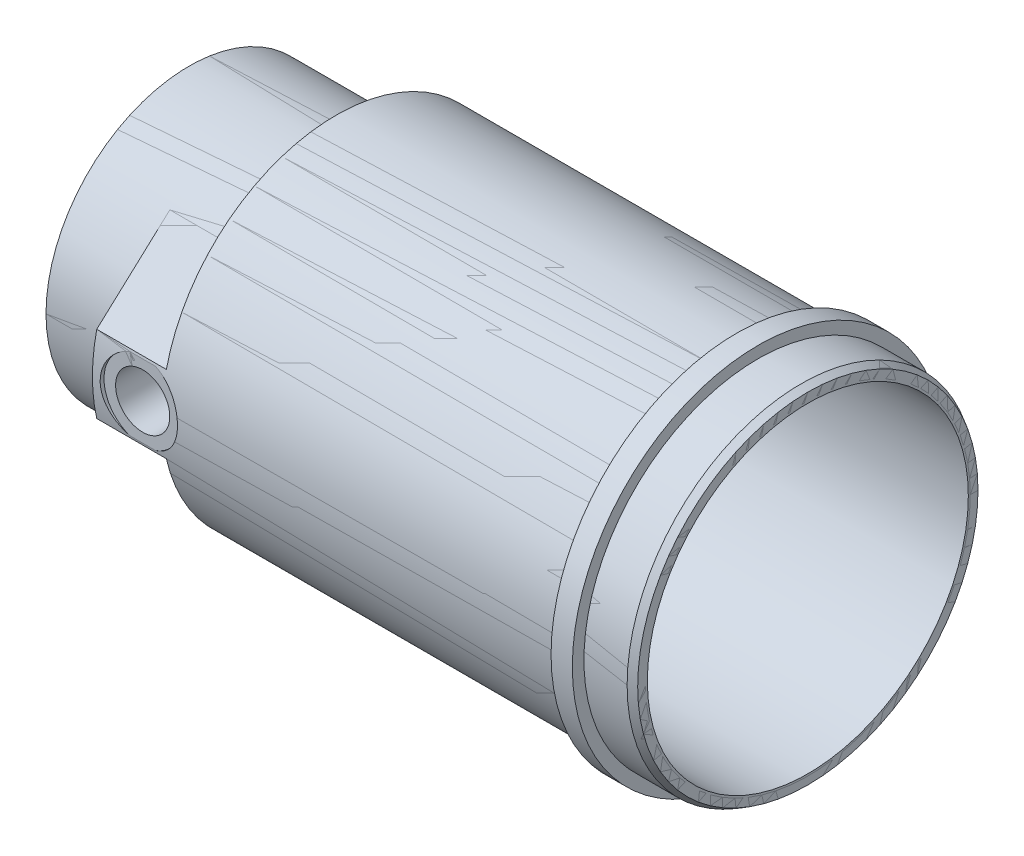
ISO-10303-21;
HEADER;
FILE_DESCRIPTION(('STEP AP214'),'2;1');
FILE_NAME('part.step','',(''),(''),'','','');
FILE_SCHEMA(('AUTOMOTIVE_DESIGN { 1 0 10303 214 1 1 1 1 }'));
ENDSEC;
DATA;
#1=APPLICATION_CONTEXT('core data for automotive mechanical design processes');
#2=APPLICATION_PROTOCOL_DEFINITION('international standard','automotive_design',2000,#1);
#3=PRODUCT_CONTEXT('',#1,'mechanical');
#4=PRODUCT('Part','Part','',(#3));
#5=PRODUCT_RELATED_PRODUCT_CATEGORY('part','',(#4));
#6=PRODUCT_DEFINITION_FORMATION('','',#4);
#7=PRODUCT_DEFINITION_CONTEXT('part definition',#1,'design');
#8=PRODUCT_DEFINITION('design','',#6,#7);
#9=PRODUCT_DEFINITION_SHAPE('','',#8);
#10=(LENGTH_UNIT() NAMED_UNIT(*) SI_UNIT(.MILLI.,.METRE.));
#11=(NAMED_UNIT(*) PLANE_ANGLE_UNIT() SI_UNIT($,.RADIAN.));
#12=(NAMED_UNIT(*) SI_UNIT($,.STERADIAN.) SOLID_ANGLE_UNIT());
#13=UNCERTAINTY_MEASURE_WITH_UNIT(LENGTH_MEASURE(1.E-05),#10,'distance_accuracy_value','');
#14=(GEOMETRIC_REPRESENTATION_CONTEXT(3) GLOBAL_UNCERTAINTY_ASSIGNED_CONTEXT((#13)) GLOBAL_UNIT_ASSIGNED_CONTEXT((#10,
#11,#12)) REPRESENTATION_CONTEXT('',''));
#15=CARTESIAN_POINT('',(0.,0.,0.));
#16=DIRECTION('',(0.,0.,1.));
#17=DIRECTION('',(1.,0.,0.));
#18=AXIS2_PLACEMENT_3D('',#15,#16,#17);
#19=CARTESIAN_POINT('',(-79.9999999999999,0.,0.));
#20=DIRECTION('',(-1.,0.,0.));
#21=DIRECTION('',(0.,0.,1.));
#22=AXIS2_PLACEMENT_3D('',#19,#20,#21);
#23=PLANE('',#22);
#24=CARTESIAN_POINT('',(-79.9999999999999,0.,0.));
#25=DIRECTION('',(-1.,0.,0.));
#26=DIRECTION('',(0.,0.,1.));
#27=AXIS2_PLACEMENT_3D('',#24,#25,#26);
#28=CIRCLE('',#27,18.5);
#29=CARTESIAN_POINT('',(-79.9999999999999,0.,18.5));
#30=VERTEX_POINT('',#29);
#31=EDGE_CURVE('P0_E320',#30,#30,#28,.F.);
#32=ORIENTED_EDGE('',*,*,#31,.F.);
#33=EDGE_LOOP('',(#32));
#34=FACE_BOUND('',#33,.T.);
#35=CARTESIAN_POINT('',(-79.9999999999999,0.,0.));
#36=DIRECTION('',(-1.,0.,0.));
#37=DIRECTION('',(0.,0.,1.));
#38=AXIS2_PLACEMENT_3D('',#35,#36,#37);
#39=CIRCLE('',#38,14.);
#40=CARTESIAN_POINT('',(-79.9999999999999,0.,14.));
#41=VERTEX_POINT('',#40);
#42=EDGE_CURVE('P0_E30',#41,#41,#39,.T.);
#43=ORIENTED_EDGE('',*,*,#42,.F.);
#44=EDGE_LOOP('',(#43));
#45=FACE_BOUND('',#44,.T.);
#46=ADVANCED_FACE('P0_F26',(#34,#45),#23,.T.);
#47=CARTESIAN_POINT('',(-79.9999999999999,0.,0.));
#48=DIRECTION('',(-1.,0.,0.));
#49=DIRECTION('',(0.,0.,1.));
#50=AXIS2_PLACEMENT_3D('',#47,#48,#49);
#51=CYLINDRICAL_SURFACE('',#50,14.);
#52=CARTESIAN_POINT('',(-81.,0.,0.));
#53=DIRECTION('',(-1.,0.,0.));
#54=DIRECTION('',(0.,0.,1.));
#55=AXIS2_PLACEMENT_3D('',#52,#53,#54);
#56=CIRCLE('',#55,14.);
#57=CARTESIAN_POINT('',(-81.,0.,14.));
#58=VERTEX_POINT('',#57);
#59=EDGE_CURVE('P0_E112',#58,#58,#56,.T.);
#60=CARTESIAN_POINT('',(-81.,0.,14.));
#61=CARTESIAN_POINT('',(-80.9895833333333,0.,14.));
#62=CARTESIAN_POINT('',(-80.9791666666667,0.,14.));
#63=CARTESIAN_POINT('',(-80.9583333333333,0.,14.));
#64=CARTESIAN_POINT('',(-80.9479166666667,0.,14.));
#65=CARTESIAN_POINT('',(-80.9270833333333,0.,14.));
#66=CARTESIAN_POINT('',(-80.9166666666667,0.,14.));
#67=CARTESIAN_POINT('',(-80.8958333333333,0.,14.));
#68=CARTESIAN_POINT('',(-80.8854166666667,0.,14.));
#69=CARTESIAN_POINT('',(-80.8645833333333,0.,14.));
#70=CARTESIAN_POINT('',(-80.8541666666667,0.,14.));
#71=CARTESIAN_POINT('',(-80.8333333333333,0.,14.));
#72=CARTESIAN_POINT('',(-80.8229166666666,0.,14.));
#73=CARTESIAN_POINT('',(-80.8020833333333,0.,14.));
#74=CARTESIAN_POINT('',(-80.7916666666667,0.,14.));
#75=CARTESIAN_POINT('',(-80.7708333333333,0.,14.));
#76=CARTESIAN_POINT('',(-80.7604166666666,0.,14.));
#77=CARTESIAN_POINT('',(-80.7395833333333,0.,14.));
#78=CARTESIAN_POINT('',(-80.7291666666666,0.,14.));
#79=CARTESIAN_POINT('',(-80.7083333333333,0.,14.));
#80=CARTESIAN_POINT('',(-80.6979166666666,0.,14.));
#81=CARTESIAN_POINT('',(-80.6770833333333,0.,14.));
#82=CARTESIAN_POINT('',(-80.6666666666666,0.,14.));
#83=CARTESIAN_POINT('',(-80.6458333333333,0.,14.));
#84=CARTESIAN_POINT('',(-80.6354166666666,0.,14.));
#85=CARTESIAN_POINT('',(-80.6145833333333,0.,14.));
#86=CARTESIAN_POINT('',(-80.6041666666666,0.,14.));
#87=CARTESIAN_POINT('',(-80.5833333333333,0.,14.));
#88=CARTESIAN_POINT('',(-80.5729166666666,0.,14.));
#89=CARTESIAN_POINT('',(-80.5520833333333,0.,14.));
#90=CARTESIAN_POINT('',(-80.5416666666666,0.,14.));
#91=CARTESIAN_POINT('',(-80.5208333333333,0.,14.));
#92=CARTESIAN_POINT('',(-80.5104166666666,0.,14.));
#93=CARTESIAN_POINT('',(-80.4895833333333,0.,14.));
#94=CARTESIAN_POINT('',(-80.4791666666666,0.,14.));
#95=CARTESIAN_POINT('',(-80.4583333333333,0.,14.));
#96=CARTESIAN_POINT('',(-80.4479166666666,0.,14.));
#97=CARTESIAN_POINT('',(-80.4270833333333,0.,14.));
#98=CARTESIAN_POINT('',(-80.4166666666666,0.,14.));
#99=CARTESIAN_POINT('',(-80.3958333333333,0.,14.));
#100=CARTESIAN_POINT('',(-80.3854166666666,0.,14.));
#101=CARTESIAN_POINT('',(-80.3645833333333,0.,14.));
#102=CARTESIAN_POINT('',(-80.3541666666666,0.,14.));
#103=CARTESIAN_POINT('',(-80.3333333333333,0.,14.));
#104=CARTESIAN_POINT('',(-80.3229166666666,0.,14.));
#105=CARTESIAN_POINT('',(-80.3020833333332,0.,14.));
#106=CARTESIAN_POINT('',(-80.2916666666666,0.,14.));
#107=CARTESIAN_POINT('',(-80.2708333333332,0.,14.));
#108=CARTESIAN_POINT('',(-80.2604166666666,0.,14.));
#109=CARTESIAN_POINT('',(-80.2395833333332,0.,14.));
#110=CARTESIAN_POINT('',(-80.2291666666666,0.,14.));
#111=CARTESIAN_POINT('',(-80.2083333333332,0.,14.));
#112=CARTESIAN_POINT('',(-80.1979166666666,0.,14.));
#113=CARTESIAN_POINT('',(-80.1770833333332,0.,14.));
#114=CARTESIAN_POINT('',(-80.1666666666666,0.,14.));
#115=CARTESIAN_POINT('',(-80.1458333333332,0.,14.));
#116=CARTESIAN_POINT('',(-80.1354166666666,0.,14.));
#117=CARTESIAN_POINT('',(-80.1145833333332,0.,14.));
#118=CARTESIAN_POINT('',(-80.1041666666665,0.,14.));
#119=CARTESIAN_POINT('',(-80.0833333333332,0.,14.));
#120=CARTESIAN_POINT('',(-80.0729166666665,0.,14.));
#121=CARTESIAN_POINT('',(-80.0520833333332,0.,14.));
#122=CARTESIAN_POINT('',(-80.0416666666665,0.,14.));
#123=CARTESIAN_POINT('',(-80.0208333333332,0.,14.));
#124=CARTESIAN_POINT('',(-80.0104166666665,0.,14.));
#125=CARTESIAN_POINT('',(-79.9999999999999,0.,14.));
#126=B_SPLINE_CURVE_WITH_KNOTS('',3,(#60,#61,#62,#63,#64,#65,#66,#67,#68,#69,#70,#71,#72,#73,
#74,#75,#76,#77,#78,#79,#80,#81,#82,#83,#84,#85,#86,#87,#88,#89,#90,#91,#92,#93,#94,#95,#96,#97,
#98,#99,#100,#101,#102,#103,#104,#105,#106,#107,#108,#109,#110,#111,#112,#113,#114,#115,#116,
#117,#118,#119,#120,#121,#122,#123,#124,#125),.UNSPECIFIED.,.F.,.F.,(4,2,2,2,2,2,2,2,2,2,2,2,2,
2,2,2,2,2,2,2,2,2,2,2,2,2,2,2,2,2,2,2,4),(0.,0.0312499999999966,0.062500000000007,
0.0937500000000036,0.125000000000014,0.156250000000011,0.187500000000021,0.218750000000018,
0.250000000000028,0.281250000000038,0.312500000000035,0.343750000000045,0.375000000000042,
0.406250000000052,0.437500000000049,0.468750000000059,0.50000000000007,0.531250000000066,
0.562500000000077,0.593750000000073,0.625000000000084,0.65625000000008,0.687500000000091,
0.718750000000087,0.750000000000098,0.781250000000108,0.812500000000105,0.843750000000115,
0.875000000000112,0.906250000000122,0.937500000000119,0.968750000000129,1.00000000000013),.UNSPECIFIED.);
#127=EDGE_CURVE('P0_BSEAM305',#58,#41,#126,.T.);
#128=ORIENTED_EDGE('',*,*,#59,.F.);
#129=ORIENTED_EDGE('',*,*,#42,.T.);
#130=ORIENTED_EDGE('',*,*,#127,.T.);
#131=ORIENTED_EDGE('',*,*,#127,.F.);
#132=EDGE_LOOP('',(#128,#130,#129,#131));
#133=FACE_BOUND('',#132,.T.);
#134=ADVANCED_FACE('P0_F305',(#133),#51,.T.);
#135=CARTESIAN_POINT('',(-61.,0.,0.));
#136=DIRECTION('',(-1.,0.,0.));
#137=DIRECTION('',(0.,0.,1.));
#138=AXIS2_PLACEMENT_3D('',#135,#136,#137);
#139=CYLINDRICAL_SURFACE('',#138,18.5);
#140=DIRECTION('',(1.,0.,0.));
#141=VECTOR('',#140,1.);
#142=CARTESIAN_POINT('',(-60.9999999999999,13.6465477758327,12.4908660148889));
#143=LINE('',#142,#141);
#144=CARTESIAN_POINT('',(-60.9999999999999,13.6465477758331,12.490866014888));
#145=VERTEX_POINT('',#144);
#146=CARTESIAN_POINT('',(-70.,13.6465477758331,12.4908660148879));
#147=VERTEX_POINT('',#146);
#148=EDGE_CURVE('P0_E100',#145,#147,#143,.F.);
#149=ORIENTED_EDGE('',*,*,#148,.F.);
#150=CARTESIAN_POINT('',(-61.,0.,0.));
#151=DIRECTION('',(-1.,0.,0.));
#152=DIRECTION('',(0.,0.,1.));
#153=AXIS2_PLACEMENT_3D('',#150,#151,#152);
#154=CIRCLE('',#153,18.5);
#155=CARTESIAN_POINT('',(-61.,-13.64654776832,12.4908660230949));
#156=VERTEX_POINT('',#155);
#157=EDGE_CURVE('P0_E125',#145,#156,#154,.T.);
#158=ORIENTED_EDGE('',*,*,#157,.T.);
#159=DIRECTION('',(1.,0.,0.));
#160=VECTOR('',#159,1.);
#161=CARTESIAN_POINT('',(-61.,-13.6465477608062,12.4908660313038));
#162=LINE('',#161,#160);
#163=CARTESIAN_POINT('',(-70.,-13.6465477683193,12.4908660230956));
#164=VERTEX_POINT('',#163);
#165=EDGE_CURVE('P0_E102',#164,#156,#162,.T.);
#166=ORIENTED_EDGE('',*,*,#165,.F.);
#167=CARTESIAN_POINT('',(-70.0000000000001,0.,0.));
#168=DIRECTION('',(-1.,0.,0.));
#169=DIRECTION('',(0.,0.,1.));
#170=AXIS2_PLACEMENT_3D('',#167,#168,#169);
#171=CIRCLE('',#170,18.5);
#172=EDGE_CURVE('P0_E91',#147,#164,#171,.F.);
#173=ORIENTED_EDGE('',*,*,#172,.F.);
#174=EDGE_LOOP('',(#149,#158,#166,#173));
#175=FACE_BOUND('',#174,.T.);
#176=ORIENTED_EDGE('',*,*,#31,.T.);
#177=EDGE_LOOP('',(#176));
#178=FACE_BOUND('',#177,.T.);
#179=ADVANCED_FACE('P0_F97',(#175,#178),#139,.T.);
#180=CARTESIAN_POINT('',(-81.,0.,0.));
#181=DIRECTION('',(-1.,0.,0.));
#182=DIRECTION('',(0.,0.,1.));
#183=AXIS2_PLACEMENT_3D('',#180,#181,#182);
#184=PLANE('',#183);
#185=CARTESIAN_POINT('',(-81.,0.,0.));
#186=DIRECTION('',(-1.,0.,0.));
#187=DIRECTION('',(0.,0.,1.));
#188=AXIS2_PLACEMENT_3D('',#185,#186,#187);
#189=CIRCLE('',#188,12.7);
#190=CARTESIAN_POINT('',(-81.,0.,12.7));
#191=VERTEX_POINT('',#190);
#192=EDGE_CURVE('P0_E124',#191,#191,#189,.F.);
#193=ORIENTED_EDGE('',*,*,#192,.T.);
#194=EDGE_LOOP('',(#193));
#195=FACE_BOUND('',#194,.T.);
#196=ORIENTED_EDGE('',*,*,#59,.T.);
#197=EDGE_LOOP('',(#196));
#198=FACE_BOUND('',#197,.T.);
#199=ADVANCED_FACE('P0_F299',(#195,#198),#184,.T.);
#200=CARTESIAN_POINT('',(-61.,5.,21.93741096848));
#201=DIRECTION('',(0.,0.737651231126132,0.675181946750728));
#202=DIRECTION('',(0.,-0.675181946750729,0.737651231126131));
#203=AXIS2_PLACEMENT_3D('',#200,#201,#202);
#204=PLANE('',#203);
#205=ORIENTED_EDGE('',*,*,#148,.T.);
#206=DIRECTION('',(0.,0.67518194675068,-0.737651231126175));
#207=VECTOR('',#206,1.);
#208=CARTESIAN_POINT('',(-70.,4.99999999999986,21.9374109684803));
#209=LINE('',#208,#207);
#210=CARTESIAN_POINT('',(-70.,4.99999999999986,21.9374109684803));
#211=VERTEX_POINT('',#210);
#212=EDGE_CURVE('P0_E103',#211,#147,#209,.T.);
#213=ORIENTED_EDGE('',*,*,#212,.F.);
#214=DIRECTION('',(1.,0.,0.));
#215=VECTOR('',#214,1.);
#216=CARTESIAN_POINT('',(-70.,4.99999999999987,21.9374109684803));
#217=LINE('',#216,#215);
#218=CARTESIAN_POINT('',(-61.,4.99999999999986,21.9374109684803));
#219=VERTEX_POINT('',#218);
#220=EDGE_CURVE('P0_E152',#219,#211,#217,.F.);
#221=ORIENTED_EDGE('',*,*,#220,.F.);
#222=DIRECTION('',(0.,0.675181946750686,-0.73765123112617));
#223=VECTOR('',#222,1.);
#224=CARTESIAN_POINT('',(-61.,4.99999999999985,21.9374109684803));
#225=LINE('',#224,#223);
#226=EDGE_CURVE('P0_E111',#219,#145,#225,.T.);
#227=ORIENTED_EDGE('',*,*,#226,.T.);
#228=EDGE_LOOP('',(#205,#213,#221,#227));
#229=FACE_BOUND('',#228,.T.);
#230=ADVANCED_FACE('P0_F107',(#229),#204,.T.);
#231=CARTESIAN_POINT('',(-70.0000000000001,0.,0.));
#232=DIRECTION('',(-1.,0.,0.));
#233=DIRECTION('',(0.,0.,1.));
#234=AXIS2_PLACEMENT_3D('',#231,#232,#233);
#235=PLANE('',#234);
#236=CARTESIAN_POINT('',(-70.0000000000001,0.,0.));
#237=DIRECTION('',(1.,0.,0.));
#238=DIRECTION('',(0.,0.,-1.));
#239=AXIS2_PLACEMENT_3D('',#236,#237,#238);
#240=CIRCLE('',#239,22.5);
#241=CARTESIAN_POINT('',(-69.9999999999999,-4.99999999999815,21.9374109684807));
#242=VERTEX_POINT('',#241);
#243=EDGE_CURVE('P0_E115',#211,#242,#240,.T.);
#244=ORIENTED_EDGE('',*,*,#243,.F.);
#245=ORIENTED_EDGE('',*,*,#212,.T.);
#246=ORIENTED_EDGE('',*,*,#172,.T.);
#247=DIRECTION('',(0.,-0.675181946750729,-0.737651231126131));
#248=VECTOR('',#247,1.);
#249=CARTESIAN_POINT('',(-70.,-13.64654777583,12.49086601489));
#250=LINE('',#249,#248);
#251=EDGE_CURVE('P0_E127',#242,#164,#250,.T.);
#252=ORIENTED_EDGE('',*,*,#251,.F.);
#253=EDGE_LOOP('',(#244,#245,#246,#252));
#254=FACE_BOUND('',#253,.T.);
#255=ADVANCED_FACE('P0_F114',(#254),#235,.T.);
#256=CARTESIAN_POINT('',(-60.9999999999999,-13.64654777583,12.49086601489));
#257=DIRECTION('',(0.,-0.737651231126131,0.675181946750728));
#258=DIRECTION('',(0.,-0.675181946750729,-0.737651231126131));
#259=AXIS2_PLACEMENT_3D('',#256,#257,#258);
#260=PLANE('',#259);
#261=DIRECTION('',(1.,0.,0.));
#262=VECTOR('',#261,1.);
#263=CARTESIAN_POINT('',(-70.,-4.99999999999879,21.9374109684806));
#264=LINE('',#263,#262);
#265=CARTESIAN_POINT('',(-60.9999999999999,-4.99999999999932,21.9374109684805));
#266=VERTEX_POINT('',#265);
#267=EDGE_CURVE('P0_E148',#242,#266,#264,.T.);
#268=ORIENTED_EDGE('',*,*,#267,.F.);
#269=ORIENTED_EDGE('',*,*,#251,.T.);
#270=ORIENTED_EDGE('',*,*,#165,.T.);
#271=DIRECTION('',(0.,0.675181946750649,0.737651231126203));
#272=VECTOR('',#271,1.);
#273=CARTESIAN_POINT('',(-61.,-13.6465477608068,12.4908660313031));
#274=LINE('',#273,#272);
#275=EDGE_CURVE('P0_E121',#156,#266,#274,.T.);
#276=ORIENTED_EDGE('',*,*,#275,.T.);
#277=EDGE_LOOP('',(#268,#269,#270,#276));
#278=FACE_BOUND('',#277,.T.);
#279=ADVANCED_FACE('P0_F290',(#278),#260,.T.);
#280=CARTESIAN_POINT('',(-61.,0.,0.));
#281=DIRECTION('',(1.,0.,0.));
#282=DIRECTION('',(0.,0.,-1.));
#283=AXIS2_PLACEMENT_3D('',#280,#281,#282);
#284=PLANE('',#283);
#285=ORIENTED_EDGE('',*,*,#275,.F.);
#286=ORIENTED_EDGE('',*,*,#157,.F.);
#287=ORIENTED_EDGE('',*,*,#226,.F.);
#288=CARTESIAN_POINT('',(-61.,0.,0.));
#289=DIRECTION('',(1.,0.,0.));
#290=DIRECTION('',(0.,0.,-1.));
#291=AXIS2_PLACEMENT_3D('',#288,#289,#290);
#292=CIRCLE('',#291,22.5);
#293=EDGE_CURVE('P0_E150',#266,#219,#292,.T.);
#294=ORIENTED_EDGE('',*,*,#293,.F.);
#295=EDGE_LOOP('',(#285,#286,#287,#294));
#296=FACE_BOUND('',#295,.T.);
#297=ADVANCED_FACE('P0_F286',(#296),#284,.F.);
#298=CARTESIAN_POINT('',(-9.19999999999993,0.,0.));
#299=DIRECTION('',(-1.,0.,0.));
#300=DIRECTION('',(0.,0.,1.));
#301=AXIS2_PLACEMENT_3D('',#298,#299,#300);
#302=PLANE('',#301);
#303=CARTESIAN_POINT('',(-9.19999999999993,0.,0.));
#304=DIRECTION('',(-1.,0.,0.));
#305=DIRECTION('',(0.,0.,1.));
#306=AXIS2_PLACEMENT_3D('',#303,#304,#305);
#307=CIRCLE('',#306,24.);
#308=CARTESIAN_POINT('',(-9.19999999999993,0.,24.));
#309=VERTEX_POINT('',#308);
#310=EDGE_CURVE('P0_E154',#309,#309,#307,.F.);
#311=ORIENTED_EDGE('',*,*,#310,.F.);
#312=EDGE_LOOP('',(#311));
#313=FACE_BOUND('',#312,.T.);
#314=CARTESIAN_POINT('',(-9.19999999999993,0.,0.));
#315=DIRECTION('',(1.,0.,0.));
#316=DIRECTION('',(0.,0.,-1.));
#317=AXIS2_PLACEMENT_3D('',#314,#315,#316);
#318=CIRCLE('',#317,22.5);
#319=CARTESIAN_POINT('',(-9.19999999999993,0.,-22.5));
#320=VERTEX_POINT('',#319);
#321=EDGE_CURVE('P0_E333',#320,#320,#318,.F.);
#322=ORIENTED_EDGE('',*,*,#321,.F.);
#323=EDGE_LOOP('',(#322));
#324=FACE_BOUND('',#323,.T.);
#325=ADVANCED_FACE('P0_F278',(#313,#324),#302,.T.);
#326=CARTESIAN_POINT('',(-34.4020202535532,0.,0.));
#327=DIRECTION('',(-1.,0.,0.));
#328=DIRECTION('',(0.,0.,1.));
#329=AXIS2_PLACEMENT_3D('',#326,#327,#328);
#330=CYLINDRICAL_SURFACE('',#329,12.7);
#331=CARTESIAN_POINT('',(-73.9999999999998,0.,0.));
#332=DIRECTION('',(-1.,0.,0.));
#333=DIRECTION('',(0.,0.,1.));
#334=AXIS2_PLACEMENT_3D('',#331,#332,#333);
#335=CIRCLE('',#334,12.7);
#336=CARTESIAN_POINT('',(-73.9999999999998,0.,12.7));
#337=VERTEX_POINT('',#336);
#338=EDGE_CURVE('P0_E229',#337,#337,#335,.T.);
#339=CARTESIAN_POINT('',(-81.,0.,12.7));
#340=CARTESIAN_POINT('',(-80.9270833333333,0.,12.7));
#341=CARTESIAN_POINT('',(-80.8541666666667,0.,12.7));
#342=CARTESIAN_POINT('',(-80.7083333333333,0.,12.7));
#343=CARTESIAN_POINT('',(-80.6354166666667,0.,12.7));
#344=CARTESIAN_POINT('',(-80.4895833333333,0.,12.7));
#345=CARTESIAN_POINT('',(-80.4166666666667,0.,12.7));
#346=CARTESIAN_POINT('',(-80.2708333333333,0.,12.7));
#347=CARTESIAN_POINT('',(-80.1979166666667,0.,12.7));
#348=CARTESIAN_POINT('',(-80.0520833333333,0.,12.7));
#349=CARTESIAN_POINT('',(-79.9791666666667,0.,12.7));
#350=CARTESIAN_POINT('',(-79.8333333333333,0.,12.7));
#351=CARTESIAN_POINT('',(-79.7604166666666,0.,12.7));
#352=CARTESIAN_POINT('',(-79.6145833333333,0.,12.7));
#353=CARTESIAN_POINT('',(-79.5416666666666,0.,12.7));
#354=CARTESIAN_POINT('',(-79.3958333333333,0.,12.7));
#355=CARTESIAN_POINT('',(-79.3229166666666,0.,12.7));
#356=CARTESIAN_POINT('',(-79.1770833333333,0.,12.7));
#357=CARTESIAN_POINT('',(-79.1041666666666,0.,12.7));
#358=CARTESIAN_POINT('',(-78.9583333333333,0.,12.7));
#359=CARTESIAN_POINT('',(-78.8854166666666,0.,12.7));
#360=CARTESIAN_POINT('',(-78.7395833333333,0.,12.7));
#361=CARTESIAN_POINT('',(-78.6666666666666,0.,12.7));
#362=CARTESIAN_POINT('',(-78.5208333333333,0.,12.7));
#363=CARTESIAN_POINT('',(-78.4479166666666,0.,12.7));
#364=CARTESIAN_POINT('',(-78.3020833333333,0.,12.7));
#365=CARTESIAN_POINT('',(-78.2291666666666,0.,12.7));
#366=CARTESIAN_POINT('',(-78.0833333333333,0.,12.7));
#367=CARTESIAN_POINT('',(-78.0104166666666,0.,12.7));
#368=CARTESIAN_POINT('',(-77.8645833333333,0.,12.7));
#369=CARTESIAN_POINT('',(-77.7916666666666,0.,12.7));
#370=CARTESIAN_POINT('',(-77.6458333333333,0.,12.7));
#371=CARTESIAN_POINT('',(-77.5729166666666,0.,12.7));
#372=CARTESIAN_POINT('',(-77.4270833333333,0.,12.7));
#373=CARTESIAN_POINT('',(-77.3541666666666,0.,12.7));
#374=CARTESIAN_POINT('',(-77.2083333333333,0.,12.7));
#375=CARTESIAN_POINT('',(-77.1354166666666,0.,12.7));
#376=CARTESIAN_POINT('',(-76.9895833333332,0.,12.7));
#377=CARTESIAN_POINT('',(-76.9166666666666,0.,12.7));
#378=CARTESIAN_POINT('',(-76.7708333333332,0.,12.7));
#379=CARTESIAN_POINT('',(-76.6979166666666,0.,12.7));
#380=CARTESIAN_POINT('',(-76.5520833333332,0.,12.7));
#381=CARTESIAN_POINT('',(-76.4791666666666,0.,12.7));
#382=CARTESIAN_POINT('',(-76.3333333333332,0.,12.7));
#383=CARTESIAN_POINT('',(-76.2604166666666,0.,12.7));
#384=CARTESIAN_POINT('',(-76.1145833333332,0.,12.7));
#385=CARTESIAN_POINT('',(-76.0416666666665,0.,12.7));
#386=CARTESIAN_POINT('',(-75.8958333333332,0.,12.7));
#387=CARTESIAN_POINT('',(-75.8229166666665,0.,12.7));
#388=CARTESIAN_POINT('',(-75.6770833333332,0.,12.7));
#389=CARTESIAN_POINT('',(-75.6041666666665,0.,12.7));
#390=CARTESIAN_POINT('',(-75.4583333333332,0.,12.7));
#391=CARTESIAN_POINT('',(-75.3854166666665,0.,12.7));
#392=CARTESIAN_POINT('',(-75.2395833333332,0.,12.7));
#393=CARTESIAN_POINT('',(-75.1666666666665,0.,12.7));
#394=CARTESIAN_POINT('',(-75.0208333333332,0.,12.7));
#395=CARTESIAN_POINT('',(-74.9479166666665,0.,12.7));
#396=CARTESIAN_POINT('',(-74.8020833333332,0.,12.7));
#397=CARTESIAN_POINT('',(-74.7291666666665,0.,12.7));
#398=CARTESIAN_POINT('',(-74.5833333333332,0.,12.7));
#399=CARTESIAN_POINT('',(-74.5104166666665,0.,12.7));
#400=CARTESIAN_POINT('',(-74.3645833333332,0.,12.7));
#401=CARTESIAN_POINT('',(-74.2916666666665,0.,12.7));
#402=CARTESIAN_POINT('',(-74.1458333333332,0.,12.7));
#403=CARTESIAN_POINT('',(-74.0729166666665,0.,12.7));
#404=CARTESIAN_POINT('',(-73.9999999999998,0.,12.7));
#405=B_SPLINE_CURVE_WITH_KNOTS('',3,(#339,#340,#341,#342,#343,#344,#345,#346,#347,#348,#349,
#350,#351,#352,#353,#354,#355,#356,#357,#358,#359,#360,#361,#362,#363,#364,#365,#366,#367,#368,
#369,#370,#371,#372,#373,#374,#375,#376,#377,#378,#379,#380,#381,#382,#383,#384,#385,#386,#387,
#388,#389,#390,#391,#392,#393,#394,#395,#396,#397,#398,#399,#400,#401,#402,#403,#404),
.UNSPECIFIED.,.F.,.F.,(4,2,2,2,2,2,2,2,2,2,2,2,2,2,2,2,2,2,2,2,2,2,2,2,2,2,2,2,2,2,2,2,4),(0.,
0.218750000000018,0.437500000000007,0.656250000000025,0.875000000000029,1.09375000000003,
1.31250000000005,1.53125000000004,1.75000000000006,1.96875000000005,2.18750000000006,
2.40625000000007,2.62500000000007,2.84375000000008,3.06250000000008,3.2812500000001,
3.50000000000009,3.7187500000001,3.93750000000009,4.15625000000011,4.37500000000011,
4.59375000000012,4.81250000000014,5.03125000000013,5.25000000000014,5.46875000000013,
5.68750000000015,5.90625000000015,6.12500000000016,6.34375000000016,6.56250000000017,
6.78125000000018,7.00000000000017),.UNSPECIFIED.);
#406=EDGE_CURVE('P0_BSEAM270',#191,#337,#405,.T.);
#407=ORIENTED_EDGE('',*,*,#192,.F.);
#408=ORIENTED_EDGE('',*,*,#338,.F.);
#409=ORIENTED_EDGE('',*,*,#406,.T.);
#410=ORIENTED_EDGE('',*,*,#406,.F.);
#411=EDGE_LOOP('',(#407,#409,#408,#410));
#412=FACE_BOUND('',#411,.T.);
#413=ADVANCED_FACE('P0_F270',(#412),#330,.F.);
#414=CARTESIAN_POINT('',(-6.4499999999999,0.,0.));
#415=DIRECTION('',(-1.,0.,0.));
#416=DIRECTION('',(0.,0.,1.));
#417=AXIS2_PLACEMENT_3D('',#414,#415,#416);
#418=CYLINDRICAL_SURFACE('',#417,24.);
#419=CARTESIAN_POINT('',(-6.4499999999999,0.,0.));
#420=DIRECTION('',(-1.,0.,0.));
#421=DIRECTION('',(0.,0.,1.));
#422=AXIS2_PLACEMENT_3D('',#419,#420,#421);
#423=CIRCLE('',#422,24.);
#424=CARTESIAN_POINT('',(-6.4499999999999,0.,24.));
#425=VERTEX_POINT('',#424);
#426=EDGE_CURVE('P0_E226',#425,#425,#423,.T.);
#427=CARTESIAN_POINT('',(-9.19999999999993,0.,24.));
#428=CARTESIAN_POINT('',(-9.17135416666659,0.,24.));
#429=CARTESIAN_POINT('',(-9.14270833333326,0.,24.));
#430=CARTESIAN_POINT('',(-9.08541666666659,0.,24.));
#431=CARTESIAN_POINT('',(-9.05677083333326,0.,24.));
#432=CARTESIAN_POINT('',(-8.99947916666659,0.,24.));
#433=CARTESIAN_POINT('',(-8.97083333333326,0.,24.));
#434=CARTESIAN_POINT('',(-8.91354166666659,0.,24.));
#435=CARTESIAN_POINT('',(-8.88489583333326,0.,24.));
#436=CARTESIAN_POINT('',(-8.82760416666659,0.,24.));
#437=CARTESIAN_POINT('',(-8.79895833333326,0.,24.));
#438=CARTESIAN_POINT('',(-8.74166666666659,0.,24.));
#439=CARTESIAN_POINT('',(-8.71302083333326,0.,24.));
#440=CARTESIAN_POINT('',(-8.65572916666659,0.,24.));
#441=CARTESIAN_POINT('',(-8.62708333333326,0.,24.));
#442=CARTESIAN_POINT('',(-8.56979166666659,0.,24.));
#443=CARTESIAN_POINT('',(-8.54114583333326,0.,24.));
#444=CARTESIAN_POINT('',(-8.48385416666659,0.,24.));
#445=CARTESIAN_POINT('',(-8.45520833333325,0.,24.));
#446=CARTESIAN_POINT('',(-8.39791666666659,0.,24.));
#447=CARTESIAN_POINT('',(-8.36927083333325,0.,24.));
#448=CARTESIAN_POINT('',(-8.31197916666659,0.,24.));
#449=CARTESIAN_POINT('',(-8.28333333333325,0.,24.));
#450=CARTESIAN_POINT('',(-8.22604166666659,0.,24.));
#451=CARTESIAN_POINT('',(-8.19739583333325,0.,24.));
#452=CARTESIAN_POINT('',(-8.14010416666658,0.,24.));
#453=CARTESIAN_POINT('',(-8.11145833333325,0.,24.));
#454=CARTESIAN_POINT('',(-8.05416666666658,0.,24.));
#455=CARTESIAN_POINT('',(-8.02552083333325,0.,24.));
#456=CARTESIAN_POINT('',(-7.96822916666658,0.,24.));
#457=CARTESIAN_POINT('',(-7.93958333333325,0.,24.));
#458=CARTESIAN_POINT('',(-7.88229166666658,0.,24.));
#459=CARTESIAN_POINT('',(-7.85364583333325,0.,24.));
#460=CARTESIAN_POINT('',(-7.79635416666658,0.,24.));
#461=CARTESIAN_POINT('',(-7.76770833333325,0.,24.));
#462=CARTESIAN_POINT('',(-7.71041666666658,0.,24.));
#463=CARTESIAN_POINT('',(-7.68177083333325,0.,24.));
#464=CARTESIAN_POINT('',(-7.62447916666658,0.,24.));
#465=CARTESIAN_POINT('',(-7.59583333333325,0.,24.));
#466=CARTESIAN_POINT('',(-7.53854166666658,0.,24.));
#467=CARTESIAN_POINT('',(-7.50989583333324,0.,24.));
#468=CARTESIAN_POINT('',(-7.45260416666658,0.,24.));
#469=CARTESIAN_POINT('',(-7.42395833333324,0.,24.));
#470=CARTESIAN_POINT('',(-7.36666666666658,0.,24.));
#471=CARTESIAN_POINT('',(-7.33802083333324,0.,24.));
#472=CARTESIAN_POINT('',(-7.28072916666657,0.,24.));
#473=CARTESIAN_POINT('',(-7.25208333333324,0.,24.));
#474=CARTESIAN_POINT('',(-7.19479166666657,0.,24.));
#475=CARTESIAN_POINT('',(-7.16614583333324,0.,24.));
#476=CARTESIAN_POINT('',(-7.10885416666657,0.,24.));
#477=CARTESIAN_POINT('',(-7.08020833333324,0.,24.));
#478=CARTESIAN_POINT('',(-7.02291666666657,0.,24.));
#479=CARTESIAN_POINT('',(-6.99427083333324,0.,24.));
#480=CARTESIAN_POINT('',(-6.93697916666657,0.,24.));
#481=CARTESIAN_POINT('',(-6.90833333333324,0.,24.));
#482=CARTESIAN_POINT('',(-6.85104166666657,0.,24.));
#483=CARTESIAN_POINT('',(-6.82239583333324,0.,24.));
#484=CARTESIAN_POINT('',(-6.76510416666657,0.,24.));
#485=CARTESIAN_POINT('',(-6.73645833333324,0.,24.));
#486=CARTESIAN_POINT('',(-6.67916666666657,0.,24.));
#487=CARTESIAN_POINT('',(-6.65052083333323,0.,24.));
#488=CARTESIAN_POINT('',(-6.59322916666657,0.,24.));
#489=CARTESIAN_POINT('',(-6.56458333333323,0.,24.));
#490=CARTESIAN_POINT('',(-6.50729166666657,0.,24.));
#491=CARTESIAN_POINT('',(-6.47864583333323,0.,24.));
#492=CARTESIAN_POINT('',(-6.4499999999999,0.,24.));
#493=B_SPLINE_CURVE_WITH_KNOTS('',3,(#427,#428,#429,#430,#431,#432,#433,#434,#435,#436,#437,
#438,#439,#440,#441,#442,#443,#444,#445,#446,#447,#448,#449,#450,#451,#452,#453,#454,#455,#456,
#457,#458,#459,#460,#461,#462,#463,#464,#465,#466,#467,#468,#469,#470,#471,#472,#473,#474,#475,
#476,#477,#478,#479,#480,#481,#482,#483,#484,#485,#486,#487,#488,#489,#490,#491,#492),
.UNSPECIFIED.,.F.,.F.,(4,2,2,2,2,2,2,2,2,2,2,2,2,2,2,2,2,2,2,2,2,2,2,2,2,2,2,2,2,2,2,2,4),(0.,
0.0859375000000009,0.171875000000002,0.257812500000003,0.343750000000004,0.429687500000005,
0.515625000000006,0.601562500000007,0.687500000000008,0.773437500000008,0.859375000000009,
0.94531250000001,1.03125000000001,1.11718750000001,1.20312500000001,1.28906250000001,
1.37500000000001,1.46093750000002,1.54687500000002,1.63281250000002,1.71875000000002,
1.80468750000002,1.89062500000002,1.97656250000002,2.06250000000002,2.14843750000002,
2.23437500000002,2.32031250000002,2.40625000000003,2.49218750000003,2.57812500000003,
2.66406250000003,2.75000000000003),.UNSPECIFIED.);
#494=EDGE_CURVE('P0_BSEAM267',#309,#425,#493,.T.);
#495=ORIENTED_EDGE('',*,*,#310,.T.);
#496=ORIENTED_EDGE('',*,*,#426,.T.);
#497=ORIENTED_EDGE('',*,*,#494,.T.);
#498=ORIENTED_EDGE('',*,*,#494,.F.);
#499=EDGE_LOOP('',(#495,#497,#496,#498));
#500=FACE_BOUND('',#499,.T.);
#501=ADVANCED_FACE('P0_F267',(#500),#418,.T.);
#502=CARTESIAN_POINT('',(-63.9999999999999,0.,22.));
#503=DIRECTION('',(0.,0.,1.));
#504=DIRECTION('',(1.,0.,0.));
#505=AXIS2_PLACEMENT_3D('',#502,#503,#504);
#506=CYLINDRICAL_SURFACE('',#505,5.);
#507=CARTESIAN_POINT('',(-63.9999999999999,0.,22.));
#508=DIRECTION('',(0.,0.,1.));
#509=DIRECTION('',(1.,0.,0.));
#510=AXIS2_PLACEMENT_3D('',#507,#508,#509);
#511=CIRCLE('',#510,5.);
#512=CARTESIAN_POINT('',(-62.3416876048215,-4.71699056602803,22.));
#513=VERTEX_POINT('',#512);
#514=CARTESIAN_POINT('',(-62.3416876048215,4.71699056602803,22.));
#515=VERTEX_POINT('',#514);
#516=EDGE_CURVE('P0_E136',#513,#515,#511,.T.);
#517=ORIENTED_EDGE('',*,*,#516,.F.);
#518=CARTESIAN_POINT('',(-62.3416876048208,4.71699056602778,22.0000000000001));
#519=CARTESIAN_POINT('',(-62.2085023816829,4.67018311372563,22.0100300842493));
#520=CARTESIAN_POINT('',(-62.0773899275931,4.61773694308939,22.0211246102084));
#521=CARTESIAN_POINT('',(-61.8202121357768,4.50203998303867,22.0450718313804));
#522=CARTESIAN_POINT('',(-61.6941460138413,4.43879088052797,22.0579242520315));
#523=CARTESIAN_POINT('',(-61.4480504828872,4.30201829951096,22.0850055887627));
#524=CARTESIAN_POINT('',(-61.3280148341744,4.2285057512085,22.099233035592));
#525=CARTESIAN_POINT('',(-61.0946433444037,4.07169052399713,22.1286624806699));
#526=CARTESIAN_POINT('',(-60.9813076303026,3.98838765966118,22.1438644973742));
#527=CARTESIAN_POINT('',(-60.7621243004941,3.81259663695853,22.1748070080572));
#528=CARTESIAN_POINT('',(-60.656274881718,3.72011070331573,22.1905473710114));
#529=CARTESIAN_POINT('',(-60.4527066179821,3.52653431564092,22.2221325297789));
#530=CARTESIAN_POINT('',(-60.3549906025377,3.42544089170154,22.2379773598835));
#531=CARTESIAN_POINT('',(-60.168383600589,3.21534721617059,22.2693246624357));
#532=CARTESIAN_POINT('',(-60.0794933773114,3.10634628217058,22.2848271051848));
#533=CARTESIAN_POINT('',(-59.9111633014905,2.88117570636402,22.3150560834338));
#534=CARTESIAN_POINT('',(-59.8317233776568,2.76500611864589,22.3297826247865));
#535=CARTESIAN_POINT('',(-59.6823652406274,2.5254861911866,22.3581429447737));
#536=CARTESIAN_POINT('',(-59.6125136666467,2.40209333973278,22.3717688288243));
#537=CARTESIAN_POINT('',(-59.4835061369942,2.14973449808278,22.3974266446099));
#538=CARTESIAN_POINT('',(-59.4243463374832,2.02077053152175,22.4094591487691));
#539=CARTESIAN_POINT('',(-59.3171975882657,1.75824933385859,22.4315824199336));
#540=CARTESIAN_POINT('',(-59.2691988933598,1.62469622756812,22.4416748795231));
#541=CARTESIAN_POINT('',(-59.1847053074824,1.35390327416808,22.4596385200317));
#542=CARTESIAN_POINT('',(-59.1482072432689,1.21666445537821,22.4675103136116));
#543=CARTESIAN_POINT('',(-59.0785886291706,0.901352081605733,22.4826336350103));
#544=CARTESIAN_POINT('',(-59.0491491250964,0.722415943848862,22.4891209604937));
#545=CARTESIAN_POINT('',(-59.009856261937,0.362308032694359,22.4978035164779));
#546=CARTESIAN_POINT('',(-59.000001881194,0.181136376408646,22.4999989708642));
#547=CARTESIAN_POINT('',(-58.9999985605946,-0.138597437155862,22.5000007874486));
#548=CARTESIAN_POINT('',(-59.005765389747,-0.277174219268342,22.4987168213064));
#549=CARTESIAN_POINT('',(-59.0287843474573,-0.553368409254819,22.4936180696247));
#550=CARTESIAN_POINT('',(-59.0460393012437,-0.690985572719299,22.4898026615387));
#551=CARTESIAN_POINT('',(-59.0919166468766,-0.964335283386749,22.4797416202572));
#552=CARTESIAN_POINT('',(-59.1205484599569,-1.10006617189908,22.4734939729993));
#553=CARTESIAN_POINT('',(-59.1889609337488,-1.36861602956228,22.4587395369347));
#554=CARTESIAN_POINT('',(-59.2287457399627,-1.50143389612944,22.4502319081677));
#555=CARTESIAN_POINT('',(-59.3190731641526,-1.76296077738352,22.4312088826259));
#556=CARTESIAN_POINT('',(-59.369597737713,-1.89167627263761,22.4206968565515));
#557=CARTESIAN_POINT('',(-59.4810807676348,-2.14440055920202,22.3979385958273));
#558=CARTESIAN_POINT('',(-59.5420431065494,-2.26840757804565,22.3856917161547));
#559=CARTESIAN_POINT('',(-59.6739247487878,-2.51079521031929,22.359802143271));
#560=CARTESIAN_POINT('',(-59.7448397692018,-2.6291782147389,22.3461600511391));
#561=CARTESIAN_POINT('',(-59.8961435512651,-2.85961401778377,22.3178429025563));
#562=CARTESIAN_POINT('',(-59.9765357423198,-2.97166450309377,22.3031674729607));
#563=CARTESIAN_POINT('',(-60.2336482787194,-3.30039426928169,22.2577330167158));
#564=CARTESIAN_POINT('',(-60.4244249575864,-3.50619722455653,22.225951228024));
#565=CARTESIAN_POINT('',(-60.8376004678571,-3.88296366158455,22.1632400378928));
#566=CARTESIAN_POINT('',(-61.0599831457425,-4.05394483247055,22.1323102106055));
#567=CARTESIAN_POINT('',(-61.4587322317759,-4.31042921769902,22.0835171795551));
#568=CARTESIAN_POINT('',(-61.6284982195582,-4.40610851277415,22.0645425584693));
#569=CARTESIAN_POINT('',(-61.9780686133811,-4.57708384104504,22.0297003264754));
#570=CARTESIAN_POINT('',(-62.1578620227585,-4.65240169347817,22.013829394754));
#571=CARTESIAN_POINT('',(-62.3416876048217,-4.71699056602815,22.));
#572=B_SPLINE_CURVE_WITH_KNOTS('',3,(#518,#519,#520,#521,#522,#523,#524,#525,#526,#527,#528,
#529,#530,#531,#532,#533,#534,#535,#536,#537,#538,#539,#540,#541,#542,#543,#544,#545,#546,#547,
#548,#549,#550,#551,#552,#553,#554,#555,#556,#557,#558,#559,#560,#561,#562,#563,#564,#565,#566,
#567,#568,#569,#570,#571),.UNSPECIFIED.,.F.,.F.,(4,2,2,2,2,2,2,2,2,2,2,2,2,2,2,2,2,2,2,2,2,2,2,
2,2,2,4),(0.,0.424435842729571,0.848805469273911,1.27272655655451,1.69665567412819,
2.12048233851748,2.54445583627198,2.96846596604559,3.39247289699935,3.81929172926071,
4.24595680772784,4.67224793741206,5.09842134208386,5.64164812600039,6.18484657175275,
6.60047767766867,7.01621103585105,7.43228938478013,7.84852259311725,8.26406191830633,
8.6797561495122,9.09527204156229,9.51093875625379,10.353982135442,11.1965961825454,
11.7827002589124,12.3681737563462),.UNSPECIFIED.);
#573=EDGE_CURVE('P0_E239',#515,#513,#572,.T.);
#574=ORIENTED_EDGE('',*,*,#573,.F.);
#575=EDGE_LOOP('',(#517,#574));
#576=FACE_BOUND('',#575,.T.);
#577=ADVANCED_FACE('P0_F269',(#576),#506,.F.);
#578=CARTESIAN_POINT('',(-63.9999999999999,0.,22.));
#579=DIRECTION('',(0.,0.,1.));
#580=DIRECTION('',(1.,0.,0.));
#581=AXIS2_PLACEMENT_3D('',#578,#579,#580);
#582=CYLINDRICAL_SURFACE('',#581,5.);
#583=CARTESIAN_POINT('',(-63.9999999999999,0.,22.));
#584=DIRECTION('',(0.,0.,1.));
#585=DIRECTION('',(1.,0.,0.));
#586=AXIS2_PLACEMENT_3D('',#583,#584,#585);
#587=CIRCLE('',#586,5.);
#588=CARTESIAN_POINT('',(-65.6583123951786,4.71699056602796,22.));
#589=VERTEX_POINT('',#588);
#590=CARTESIAN_POINT('',(-65.6583123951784,-4.71699056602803,22.0000000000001));
#591=VERTEX_POINT('',#590);
#592=EDGE_CURVE('P0_E132',#589,#591,#587,.T.);
#593=ORIENTED_EDGE('',*,*,#592,.F.);
#594=CARTESIAN_POINT('',(-65.6583123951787,-4.71699056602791,22.0000000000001));
#595=CARTESIAN_POINT('',(-65.7914976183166,-4.67018311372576,22.0100300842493));
#596=CARTESIAN_POINT('',(-65.9226100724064,-4.61773694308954,22.0211246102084));
#597=CARTESIAN_POINT('',(-66.1797878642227,-4.50203998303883,22.0450718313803));
#598=CARTESIAN_POINT('',(-66.3058539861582,-4.43879088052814,22.0579242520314));
#599=CARTESIAN_POINT('',(-66.5519495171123,-4.30201829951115,22.0850055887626));
#600=CARTESIAN_POINT('',(-66.6719851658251,-4.22850575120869,22.099233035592));
#601=CARTESIAN_POINT('',(-66.9053566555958,-4.07169052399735,22.1286624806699));
#602=CARTESIAN_POINT('',(-67.0186923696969,-3.9883876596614,22.1438644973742));
#603=CARTESIAN_POINT('',(-67.2378756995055,-3.81259663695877,22.1748070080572));
#604=CARTESIAN_POINT('',(-67.3437251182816,-3.72011070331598,22.1905473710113));
#605=CARTESIAN_POINT('',(-67.5472933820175,-3.52653431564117,22.2221325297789));
#606=CARTESIAN_POINT('',(-67.6450093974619,-3.4254408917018,22.2379773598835));
#607=CARTESIAN_POINT('',(-67.8316163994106,-3.21534721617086,22.2693246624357));
#608=CARTESIAN_POINT('',(-67.9205066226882,-3.10634628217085,22.2848271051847));
#609=CARTESIAN_POINT('',(-68.0888366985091,-2.88117570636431,22.3150560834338));
#610=CARTESIAN_POINT('',(-68.1682766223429,-2.76500611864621,22.3297826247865));
#611=CARTESIAN_POINT('',(-68.3176347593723,-2.52548619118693,22.3581429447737));
#612=CARTESIAN_POINT('',(-68.387486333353,-2.40209333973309,22.3717688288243));
#613=CARTESIAN_POINT('',(-68.5164938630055,-2.14973449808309,22.3974266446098));
#614=CARTESIAN_POINT('',(-68.5756536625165,-2.02077053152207,22.4094591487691));
#615=CARTESIAN_POINT('',(-68.682802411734,-1.75824933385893,22.4315824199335));
#616=CARTESIAN_POINT('',(-68.7308011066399,-1.62469622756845,22.4416748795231));
#617=CARTESIAN_POINT('',(-68.8152946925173,-1.35390327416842,22.4596385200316));
#618=CARTESIAN_POINT('',(-68.851792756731,-1.21666445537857,22.4675103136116));
#619=CARTESIAN_POINT('',(-68.9214113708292,-0.901352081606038,22.4826336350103));
#620=CARTESIAN_POINT('',(-68.9508508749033,-0.722415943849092,22.4891209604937));
#621=CARTESIAN_POINT('',(-68.9901437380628,-0.362308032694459,22.4978035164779));
#622=CARTESIAN_POINT('',(-68.9999981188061,-0.181136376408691,22.4999989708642));
#623=CARTESIAN_POINT('',(-69.0000014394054,0.138597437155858,22.5000007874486));
#624=CARTESIAN_POINT('',(-68.9942346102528,0.277174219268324,22.4987168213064));
#625=CARTESIAN_POINT('',(-68.9712156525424,0.553368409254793,22.4936180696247));
#626=CARTESIAN_POINT('',(-68.9539606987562,0.690985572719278,22.4898026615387));
#627=CARTESIAN_POINT('',(-68.9080833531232,0.964335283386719,22.4797416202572));
#628=CARTESIAN_POINT('',(-68.8794515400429,1.10006617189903,22.4734939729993));
#629=CARTESIAN_POINT('',(-68.811039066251,1.36861602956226,22.4587395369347));
#630=CARTESIAN_POINT('',(-68.7712542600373,1.50143389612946,22.4502319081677));
#631=CARTESIAN_POINT('',(-68.6809268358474,1.76296077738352,22.4312088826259));
#632=CARTESIAN_POINT('',(-68.6304022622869,1.89167627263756,22.4206968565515));
#633=CARTESIAN_POINT('',(-68.5189192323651,2.14440055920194,22.3979385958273));
#634=CARTESIAN_POINT('',(-68.4579568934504,2.26840757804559,22.3856917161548));
#635=CARTESIAN_POINT('',(-68.326075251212,2.51079521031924,22.359802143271));
#636=CARTESIAN_POINT('',(-68.2551602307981,2.62917821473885,22.3461600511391));
#637=CARTESIAN_POINT('',(-68.1038564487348,2.85961401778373,22.3178429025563));
#638=CARTESIAN_POINT('',(-68.0234642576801,2.97166450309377,22.3031674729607));
#639=CARTESIAN_POINT('',(-67.7663517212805,3.30039426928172,22.2577330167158));
#640=CARTESIAN_POINT('',(-67.5755750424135,3.50619722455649,22.225951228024));
#641=CARTESIAN_POINT('',(-67.1623995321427,3.88296366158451,22.1632400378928));
#642=CARTESIAN_POINT('',(-66.9400168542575,4.05394483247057,22.1323102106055));
#643=CARTESIAN_POINT('',(-66.5412677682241,4.31042921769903,22.0835171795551));
#644=CARTESIAN_POINT('',(-66.3715017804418,4.40610851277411,22.0645425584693));
#645=CARTESIAN_POINT('',(-66.0219313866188,4.57708384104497,22.0297003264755));
#646=CARTESIAN_POINT('',(-65.8421379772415,4.65240169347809,22.013829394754));
#647=CARTESIAN_POINT('',(-65.6583123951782,4.71699056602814,22.));
#648=B_SPLINE_CURVE_WITH_KNOTS('',3,(#594,#595,#596,#597,#598,#599,#600,#601,#602,#603,#604,
#605,#606,#607,#608,#609,#610,#611,#612,#613,#614,#615,#616,#617,#618,#619,#620,#621,#622,#623,
#624,#625,#626,#627,#628,#629,#630,#631,#632,#633,#634,#635,#636,#637,#638,#639,#640,#641,#642,
#643,#644,#645,#646,#647),.UNSPECIFIED.,.F.,.F.,(4,2,2,2,2,2,2,2,2,2,2,2,2,2,2,2,2,2,2,2,2,2,2,
2,2,2,4),(0.,0.424435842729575,0.848805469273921,1.27272655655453,1.69665567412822,
2.12048233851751,2.54445583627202,2.96846596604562,3.39247289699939,3.81929172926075,
4.24595680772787,4.6722479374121,5.0984213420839,5.64164812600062,6.18484657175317,
6.60047767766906,7.01621103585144,7.43228938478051,7.84852259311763,8.26406191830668,
8.67975614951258,9.09527204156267,9.51093875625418,10.3539821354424,11.1965961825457,
11.7827002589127,12.3681737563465),.UNSPECIFIED.);
#649=EDGE_CURVE('P0_E232',#591,#589,#648,.T.);
#650=ORIENTED_EDGE('',*,*,#649,.F.);
#651=EDGE_LOOP('',(#593,#650));
#652=FACE_BOUND('',#651,.T.);
#653=ADVANCED_FACE('P0_F245',(#652),#582,.F.);
#654=CARTESIAN_POINT('',(-70.0000000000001,0.,0.));
#655=DIRECTION('',(1.,0.,0.));
#656=DIRECTION('',(0.,0.,-1.));
#657=AXIS2_PLACEMENT_3D('',#654,#655,#656);
#658=CYLINDRICAL_SURFACE('',#657,22.5);
#659=ORIENTED_EDGE('',*,*,#220,.T.);
#660=ORIENTED_EDGE('',*,*,#243,.T.);
#661=ORIENTED_EDGE('',*,*,#267,.T.);
#662=ORIENTED_EDGE('',*,*,#293,.T.);
#663=EDGE_LOOP('',(#659,#660,#661,#662));
#664=FACE_BOUND('',#663,.T.);
#665=ORIENTED_EDGE('',*,*,#321,.T.);
#666=EDGE_LOOP('',(#665));
#667=FACE_BOUND('',#666,.T.);
#668=DIRECTION('',(1.,0.,0.));
#669=VECTOR('',#668,1.);
#670=CARTESIAN_POINT('',(0.,-4.71699056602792,22.));
#671=LINE('',#670,#669);
#672=EDGE_CURVE('P0_E128',#591,#513,#671,.T.);
#673=ORIENTED_EDGE('',*,*,#672,.F.);
#674=ORIENTED_EDGE('',*,*,#649,.T.);
#675=DIRECTION('',(1.,0.,0.));
#676=VECTOR('',#675,1.);
#677=CARTESIAN_POINT('',(0.,4.71699056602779,22.));
#678=LINE('',#677,#676);
#679=EDGE_CURVE('P0_E133',#515,#589,#678,.F.);
#680=ORIENTED_EDGE('',*,*,#679,.F.);
#681=ORIENTED_EDGE('',*,*,#573,.T.);
#682=EDGE_LOOP('',(#673,#674,#680,#681));
#683=FACE_BOUND('',#682,.T.);
#684=ADVANCED_FACE('P0_F247',(#664,#667,#683),#658,.T.);
#685=CARTESIAN_POINT('',(-73.9999999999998,0.,0.));
#686=DIRECTION('',(1.,0.,0.));
#687=DIRECTION('',(0.,0.,-1.));
#688=AXIS2_PLACEMENT_3D('',#685,#686,#687);
#689=PLANE('',#688);
#690=ORIENTED_EDGE('',*,*,#338,.T.);
#691=EDGE_LOOP('',(#690));
#692=FACE_BOUND('',#691,.T.);
#693=CARTESIAN_POINT('',(-73.9999999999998,0.,0.));
#694=DIRECTION('',(1.,0.,0.));
#695=DIRECTION('',(0.,0.,-1.));
#696=AXIS2_PLACEMENT_3D('',#693,#694,#695);
#697=CIRCLE('',#696,14.);
#698=CARTESIAN_POINT('',(-73.9999999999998,0.,-14.));
#699=VERTEX_POINT('',#698);
#700=EDGE_CURVE('P0_E131',#699,#699,#697,.T.);
#701=ORIENTED_EDGE('',*,*,#700,.T.);
#702=EDGE_LOOP('',(#701));
#703=FACE_BOUND('',#702,.T.);
#704=ADVANCED_FACE('P0_F251',(#692,#703),#689,.T.);
#705=CARTESIAN_POINT('',(-6.4499999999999,0.,0.));
#706=DIRECTION('',(-1.,0.,0.));
#707=DIRECTION('',(0.,0.,1.));
#708=AXIS2_PLACEMENT_3D('',#705,#706,#707);
#709=PLANE('',#708);
#710=ORIENTED_EDGE('',*,*,#426,.F.);
#711=EDGE_LOOP('',(#710));
#712=FACE_BOUND('',#711,.T.);
#713=CARTESIAN_POINT('',(-6.4499999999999,0.,0.));
#714=DIRECTION('',(1.,0.,0.));
#715=DIRECTION('',(0.,0.,-1.));
#716=AXIS2_PLACEMENT_3D('',#713,#714,#715);
#717=CIRCLE('',#716,22.5);
#718=CARTESIAN_POINT('',(-6.4499999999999,0.,-22.5));
#719=VERTEX_POINT('',#718);
#720=EDGE_CURVE('P0_E219',#719,#719,#717,.T.);
#721=ORIENTED_EDGE('',*,*,#720,.F.);
#722=EDGE_LOOP('',(#721));
#723=FACE_BOUND('',#722,.T.);
#724=ADVANCED_FACE('P0_F255',(#712,#723),#709,.F.);
#725=CARTESIAN_POINT('',(0.,0.,22.));
#726=DIRECTION('',(0.,0.,1.));
#727=DIRECTION('',(1.,0.,0.));
#728=AXIS2_PLACEMENT_3D('',#725,#726,#727);
#729=PLANE('',#728);
#730=ORIENTED_EDGE('',*,*,#592,.T.);
#731=ORIENTED_EDGE('',*,*,#672,.T.);
#732=ORIENTED_EDGE('',*,*,#516,.T.);
#733=ORIENTED_EDGE('',*,*,#679,.T.);
#734=EDGE_LOOP('',(#730,#731,#732,#733));
#735=FACE_BOUND('',#734,.T.);
#736=CARTESIAN_POINT('',(-63.9999999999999,0.,22.));
#737=DIRECTION('',(0.,0.,1.));
#738=DIRECTION('',(1.,0.,0.));
#739=AXIS2_PLACEMENT_3D('',#736,#737,#738);
#740=CIRCLE('',#739,3.5);
#741=CARTESIAN_POINT('',(-60.4999999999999,0.,22.));
#742=VERTEX_POINT('',#741);
#743=EDGE_CURVE('P0_E140',#742,#742,#740,.F.);
#744=ORIENTED_EDGE('',*,*,#743,.T.);
#745=EDGE_LOOP('',(#744));
#746=FACE_BOUND('',#745,.T.);
#747=ADVANCED_FACE('P0_F204',(#735,#746),#729,.T.);
#748=CARTESIAN_POINT('',(-73.9999999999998,0.,0.));
#749=DIRECTION('',(1.,0.,0.));
#750=DIRECTION('',(0.,0.,-1.));
#751=AXIS2_PLACEMENT_3D('',#748,#749,#750);
#752=CYLINDRICAL_SURFACE('',#751,14.);
#753=ORIENTED_EDGE('',*,*,#700,.F.);
#754=EDGE_LOOP('',(#753));
#755=FACE_BOUND('',#754,.T.);
#756=CARTESIAN_POINT('',(-64.,0.,0.));
#757=DIRECTION('',(1.,0.,0.));
#758=DIRECTION('',(0.,0.,-1.));
#759=AXIS2_PLACEMENT_3D('',#756,#757,#758);
#760=CIRCLE('',#759,14.);
#761=CARTESIAN_POINT('',(-63.9999999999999,3.5,13.555441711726));
#762=VERTEX_POINT('',#761);
#763=CARTESIAN_POINT('',(-63.9999999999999,-3.5,13.555441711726));
#764=VERTEX_POINT('',#763);
#765=EDGE_CURVE('P0_E141',#762,#764,#760,.F.);
#766=ORIENTED_EDGE('',*,*,#765,.F.);
#767=CARTESIAN_POINT('',(-63.9999999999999,3.5,13.555441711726));
#768=CARTESIAN_POINT('',(-64.0967928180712,3.50001121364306,13.5554308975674));
#769=CARTESIAN_POINT('',(-64.1935789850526,3.4959849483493,13.5564781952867));
#770=CARTESIAN_POINT('',(-64.3864275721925,3.47994455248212,13.5606088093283));
#771=CARTESIAN_POINT('',(-64.4824901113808,3.46793176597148,13.5636917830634));
#772=CARTESIAN_POINT('',(-64.673025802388,3.43603687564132,13.5718055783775));
#773=CARTESIAN_POINT('',(-64.7675017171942,3.41617035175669,13.5768325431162));
#774=CARTESIAN_POINT('',(-64.9543641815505,3.3687524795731,13.5886754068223));
#775=CARTESIAN_POINT('',(-65.0467507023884,3.34120102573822,13.5954913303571));
#776=CARTESIAN_POINT('',(-65.3197973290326,3.24732060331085,13.6183374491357));
#777=CARTESIAN_POINT('',(-65.4965326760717,3.16973378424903,13.6367745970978));
#778=CARTESIAN_POINT('',(-65.8344339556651,2.98694237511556,13.6779712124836));
#779=CARTESIAN_POINT('',(-65.9955962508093,2.88173135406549,13.700731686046));
#780=CARTESIAN_POINT('',(-66.3013776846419,2.64421002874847,13.7485665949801));
#781=CARTESIAN_POINT('',(-66.4456104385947,2.51140876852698,13.7736776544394));
#782=CARTESIAN_POINT('',(-66.7100363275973,2.22349423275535,13.8230738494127));
#783=CARTESIAN_POINT('',(-66.8302208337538,2.06837298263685,13.8473586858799));
#784=CARTESIAN_POINT('',(-67.0447415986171,1.73752039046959,13.8927779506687));
#785=CARTESIAN_POINT('',(-67.1386820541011,1.56152516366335,13.9138621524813));
#786=CARTESIAN_POINT('',(-67.2954025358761,1.19574806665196,13.9500472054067));
#787=CARTESIAN_POINT('',(-67.358219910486,1.00598303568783,13.9651552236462));
#788=CARTESIAN_POINT('',(-67.4361464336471,0.679391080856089,13.9841412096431));
#789=CARTESIAN_POINT('',(-67.4600502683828,0.544715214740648,13.9900574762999));
#790=CARTESIAN_POINT('',(-67.4919799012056,0.273378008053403,13.9979886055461));
#791=CARTESIAN_POINT('',(-67.5000059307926,0.136716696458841,14.0000035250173));
#792=CARTESIAN_POINT('',(-67.4999916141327,-0.193311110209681,13.999995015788));
#793=CARTESIAN_POINT('',(-67.4839252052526,-0.386732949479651,13.9959546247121));
#794=CARTESIAN_POINT('',(-67.4201605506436,-0.768083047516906,13.9802209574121));
#795=CARTESIAN_POINT('',(-67.3724321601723,-0.956005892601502,13.9685203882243));
#796=CARTESIAN_POINT('',(-67.2469730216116,-1.32071875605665,13.938764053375));
#797=CARTESIAN_POINT('',(-67.1692832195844,-1.49752358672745,13.9207169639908));
#798=CARTESIAN_POINT('',(-66.9862371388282,-1.83557843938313,13.8801900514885));
#799=CARTESIAN_POINT('',(-66.8808815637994,-1.99682885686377,13.8577103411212));
#800=CARTESIAN_POINT('',(-66.6432012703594,-2.30253404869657,13.8102402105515));
#801=CARTESIAN_POINT('',(-66.5104137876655,-2.44662302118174,13.7852110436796));
#802=CARTESIAN_POINT('',(-66.2226174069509,-2.71074216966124,13.7357188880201));
#803=CARTESIAN_POINT('',(-66.0676049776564,-2.83076851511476,13.7112559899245));
#804=CARTESIAN_POINT('',(-65.736900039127,-3.04509316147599,13.6652714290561));
#805=CARTESIAN_POINT('',(-65.5609300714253,-3.13897462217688,13.6437998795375));
#806=CARTESIAN_POINT('',(-65.1951218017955,-3.29563322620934,13.6068115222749));
#807=CARTESIAN_POINT('',(-65.0052940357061,-3.35843372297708,13.5912902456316));
#808=CARTESIAN_POINT('',(-64.678706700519,-3.43627570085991,13.5717754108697));
#809=CARTESIAN_POINT('',(-64.5441087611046,-3.46013508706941,13.5656896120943));
#810=CARTESIAN_POINT('',(-64.2730314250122,-3.49200716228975,13.5575055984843));
#811=CARTESIAN_POINT('',(-64.1365534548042,-3.50003126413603,13.5554045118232));
#812=CARTESIAN_POINT('',(-63.9999999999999,-3.5,13.555441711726));
#813=B_SPLINE_CURVE_WITH_KNOTS('',3,(#767,#768,#769,#770,#771,#772,#773,#774,#775,#776,#777,
#778,#779,#780,#781,#782,#783,#784,#785,#786,#787,#788,#789,#790,#791,#792,#793,#794,#795,#796,
#797,#798,#799,#800,#801,#802,#803,#804,#805,#806,#807,#808,#809,#810,#811,#812),.UNSPECIFIED.,
.F.,.F.,(4,2,2,2,2,2,2,2,2,2,2,2,2,2,2,2,2,2,2,2,2,2,4),(0.,0.290277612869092,0.580506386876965,
0.870162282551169,1.1598221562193,1.7385759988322,2.3174646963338,2.90770535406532,
3.49815742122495,4.09708513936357,4.69529238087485,5.10509015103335,5.51488194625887,
6.09430866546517,6.67428783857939,7.2534771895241,7.83265180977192,8.42253847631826,
9.01251897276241,9.61142786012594,10.2098860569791,10.6194487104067,11.0287160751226),.UNSPECIFIED.);
#814=EDGE_CURVE('P0_E143',#762,#764,#813,.T.);
#815=ORIENTED_EDGE('',*,*,#814,.T.);
#816=EDGE_LOOP('',(#766,#815));
#817=FACE_BOUND('',#816,.T.);
#818=ADVANCED_FACE('P0_F196',(#755,#817),#752,.F.);
#819=CARTESIAN_POINT('',(-6.4499999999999,0.,0.));
#820=DIRECTION('',(1.,0.,0.));
#821=DIRECTION('',(0.,0.,-1.));
#822=AXIS2_PLACEMENT_3D('',#819,#820,#821);
#823=CYLINDRICAL_SURFACE('',#822,22.5);
#824=CARTESIAN_POINT('',(-0.866007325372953,-1.56125112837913E-13,0.));
#825=DIRECTION('',(-1.,0.,0.));
#826=DIRECTION('',(0.,0.,1.));
#827=AXIS2_PLACEMENT_3D('',#824,#825,#826);
#828=CIRCLE('',#827,22.5);
#829=CARTESIAN_POINT('',(-0.866007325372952,0.,-22.5));
#830=VERTEX_POINT('',#829);
#831=EDGE_CURVE('P0_E144',#830,#830,#828,.F.);
#832=CARTESIAN_POINT('',(-6.4499999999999,0.,-22.5));
#833=CARTESIAN_POINT('',(-6.3918334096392,0.,-22.5));
#834=CARTESIAN_POINT('',(-6.33366681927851,0.,-22.5));
#835=CARTESIAN_POINT('',(-6.21733363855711,0.,-22.5));
#836=CARTESIAN_POINT('',(-6.15916704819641,0.,-22.5));
#837=CARTESIAN_POINT('',(-6.04283386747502,0.,-22.5));
#838=CARTESIAN_POINT('',(-5.98466727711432,0.,-22.5));
#839=CARTESIAN_POINT('',(-5.86833409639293,0.,-22.5));
#840=CARTESIAN_POINT('',(-5.81016750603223,0.,-22.5));
#841=CARTESIAN_POINT('',(-5.69383432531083,0.,-22.5));
#842=CARTESIAN_POINT('',(-5.63566773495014,0.,-22.5));
#843=CARTESIAN_POINT('',(-5.51933455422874,0.,-22.5));
#844=CARTESIAN_POINT('',(-5.46116796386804,0.,-22.5));
#845=CARTESIAN_POINT('',(-5.34483478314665,0.,-22.5));
#846=CARTESIAN_POINT('',(-5.28666819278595,0.,-22.5));
#847=CARTESIAN_POINT('',(-5.17033501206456,0.,-22.5));
#848=CARTESIAN_POINT('',(-5.11216842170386,0.,-22.5));
#849=CARTESIAN_POINT('',(-4.99583524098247,0.,-22.5));
#850=CARTESIAN_POINT('',(-4.93766865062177,0.,-22.5));
#851=CARTESIAN_POINT('',(-4.82133546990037,0.,-22.5));
#852=CARTESIAN_POINT('',(-4.76316887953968,0.,-22.5));
#853=CARTESIAN_POINT('',(-4.64683569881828,0.,-22.5));
#854=CARTESIAN_POINT('',(-4.58866910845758,0.,-22.5));
#855=CARTESIAN_POINT('',(-4.47233592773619,0.,-22.5));
#856=CARTESIAN_POINT('',(-4.41416933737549,0.,-22.5));
#857=CARTESIAN_POINT('',(-4.2978361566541,0.,-22.5));
#858=CARTESIAN_POINT('',(-4.2396695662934,0.,-22.5));
#859=CARTESIAN_POINT('',(-4.12333638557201,0.,-22.5));
#860=CARTESIAN_POINT('',(-4.06516979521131,0.,-22.5));
#861=CARTESIAN_POINT('',(-3.94883661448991,0.,-22.5));
#862=CARTESIAN_POINT('',(-3.89067002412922,0.,-22.5));
#863=CARTESIAN_POINT('',(-3.77433684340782,0.,-22.5));
#864=CARTESIAN_POINT('',(-3.71617025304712,0.,-22.5));
#865=CARTESIAN_POINT('',(-3.59983707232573,0.,-22.5));
#866=CARTESIAN_POINT('',(-3.54167048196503,0.,-22.5));
#867=CARTESIAN_POINT('',(-3.42533730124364,0.,-22.5));
#868=CARTESIAN_POINT('',(-3.36717071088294,0.,-22.5));
#869=CARTESIAN_POINT('',(-3.25083753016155,0.,-22.5));
#870=CARTESIAN_POINT('',(-3.19267093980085,0.,-22.5));
#871=CARTESIAN_POINT('',(-3.07633775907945,0.,-22.5));
#872=CARTESIAN_POINT('',(-3.01817116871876,0.,-22.5));
#873=CARTESIAN_POINT('',(-2.90183798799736,0.,-22.5));
#874=CARTESIAN_POINT('',(-2.84367139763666,0.,-22.5));
#875=CARTESIAN_POINT('',(-2.72733821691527,0.,-22.5));
#876=CARTESIAN_POINT('',(-2.66917162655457,0.,-22.5));
#877=CARTESIAN_POINT('',(-2.55283844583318,0.,-22.5));
#878=CARTESIAN_POINT('',(-2.49467185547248,0.,-22.5));
#879=CARTESIAN_POINT('',(-2.37833867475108,0.,-22.5));
#880=CARTESIAN_POINT('',(-2.32017208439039,0.,-22.5));
#881=CARTESIAN_POINT('',(-2.20383890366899,0.,-22.5));
#882=CARTESIAN_POINT('',(-2.14567231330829,0.,-22.5));
#883=CARTESIAN_POINT('',(-2.0293391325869,0.,-22.5));
#884=CARTESIAN_POINT('',(-1.9711725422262,0.,-22.5));
#885=CARTESIAN_POINT('',(-1.85483936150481,0.,-22.5));
#886=CARTESIAN_POINT('',(-1.79667277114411,0.,-22.5));
#887=CARTESIAN_POINT('',(-1.68033959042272,0.,-22.5));
#888=CARTESIAN_POINT('',(-1.62217300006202,0.,-22.5));
#889=CARTESIAN_POINT('',(-1.50583981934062,0.,-22.5));
#890=CARTESIAN_POINT('',(-1.44767322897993,0.,-22.5));
#891=CARTESIAN_POINT('',(-1.33134004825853,0.,-22.5));
#892=CARTESIAN_POINT('',(-1.27317345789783,0.,-22.5));
#893=CARTESIAN_POINT('',(-1.15684027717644,0.,-22.5));
#894=CARTESIAN_POINT('',(-1.09867368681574,0.,-22.5));
#895=CARTESIAN_POINT('',(-0.982340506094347,0.,-22.5));
#896=CARTESIAN_POINT('',(-0.924173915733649,0.,-22.5));
#897=CARTESIAN_POINT('',(-0.866007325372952,0.,-22.5));
#898=B_SPLINE_CURVE_WITH_KNOTS('',3,(#832,#833,#834,#835,#836,#837,#838,#839,#840,#841,#842,
#843,#844,#845,#846,#847,#848,#849,#850,#851,#852,#853,#854,#855,#856,#857,#858,#859,#860,#861,
#862,#863,#864,#865,#866,#867,#868,#869,#870,#871,#872,#873,#874,#875,#876,#877,#878,#879,#880,
#881,#882,#883,#884,#885,#886,#887,#888,#889,#890,#891,#892,#893,#894,#895,#896,#897),
.UNSPECIFIED.,.F.,.F.,(4,2,2,2,2,2,2,2,2,2,2,2,2,2,2,2,2,2,2,2,2,2,2,2,2,2,2,2,2,2,2,2,4),(0.,
0.174499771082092,0.348999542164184,0.523499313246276,0.697999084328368,0.872498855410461,
1.04699862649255,1.22149839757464,1.39599816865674,1.57049793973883,1.74499771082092,
1.91949748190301,2.09399725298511,2.2684970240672,2.44299679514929,2.61749656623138,
2.79199633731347,2.96649610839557,3.14099587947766,3.31549565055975,3.48999542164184,
3.66449519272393,3.83899496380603,4.01349473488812,4.18799450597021,4.3624942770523,
4.5369940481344,4.71149381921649,4.88599359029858,5.06049336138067,5.23499313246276,
5.40949290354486,5.58399267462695),.UNSPECIFIED.);
#899=EDGE_CURVE('P0_BSEAM193',#719,#830,#898,.T.);
#900=ORIENTED_EDGE('',*,*,#720,.T.);
#901=ORIENTED_EDGE('',*,*,#831,.F.);
#902=ORIENTED_EDGE('',*,*,#899,.T.);
#903=ORIENTED_EDGE('',*,*,#899,.F.);
#904=EDGE_LOOP('',(#900,#902,#901,#903));
#905=FACE_BOUND('',#904,.T.);
#906=ADVANCED_FACE('P0_F193',(#905),#823,.T.);
#907=CARTESIAN_POINT('',(-64.,0.,0.));
#908=DIRECTION('',(1.,0.,0.));
#909=DIRECTION('',(0.,0.,-1.));
#910=AXIS2_PLACEMENT_3D('',#907,#908,#909);
#911=PLANE('',#910);
#912=DIRECTION('',(0.,0.,-1.));
#913=VECTOR('',#912,1.);
#914=CARTESIAN_POINT('',(-64.0000000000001,-3.5,0.));
#915=LINE('',#914,#913);
#916=CARTESIAN_POINT('',(-64.0000000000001,-3.50000000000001,16.3802472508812));
#917=VERTEX_POINT('',#916);
#918=EDGE_CURVE('P0_E137',#764,#917,#915,.F.);
#919=ORIENTED_EDGE('',*,*,#918,.T.);
#920=CARTESIAN_POINT('',(-64.,0.,0.));
#921=DIRECTION('',(1.,0.,0.));
#922=DIRECTION('',(0.,0.,-1.));
#923=AXIS2_PLACEMENT_3D('',#920,#921,#922);
#924=CIRCLE('',#923,16.75);
#925=CARTESIAN_POINT('',(-64.,3.50000000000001,16.3802472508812));
#926=VERTEX_POINT('',#925);
#927=EDGE_CURVE('P0_E147',#917,#926,#924,.T.);
#928=ORIENTED_EDGE('',*,*,#927,.T.);
#929=DIRECTION('',(0.,0.,1.));
#930=VECTOR('',#929,1.);
#931=CARTESIAN_POINT('',(-64.,3.50000000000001,13.5047743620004));
#932=LINE('',#931,#930);
#933=EDGE_CURVE('P0_E45',#926,#762,#932,.F.);
#934=ORIENTED_EDGE('',*,*,#933,.T.);
#935=ORIENTED_EDGE('',*,*,#765,.T.);
#936=EDGE_LOOP('',(#919,#928,#934,#935));
#937=FACE_BOUND('',#936,.T.);
#938=ADVANCED_FACE('P0_F195',(#937),#911,.T.);
#939=CARTESIAN_POINT('',(-64.,0.,13.5047743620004));
#940=DIRECTION('',(0.,0.,1.));
#941=DIRECTION('',(1.,0.,0.));
#942=AXIS2_PLACEMENT_3D('',#939,#940,#941);
#943=CYLINDRICAL_SURFACE('',#942,3.5);
#944=CARTESIAN_POINT('',(-64.,3.50000000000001,16.3802472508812));
#945=CARTESIAN_POINT('',(-63.9027073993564,3.50001067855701,16.3802383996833));
#946=CARTESIAN_POINT('',(-63.8054207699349,3.49594333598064,16.3811138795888));
#947=CARTESIAN_POINT('',(-63.6115651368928,3.47973545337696,16.3845679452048));
#948=CARTESIAN_POINT('',(-63.5149960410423,3.46759596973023,16.3871463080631));
#949=CARTESIAN_POINT('',(-63.3234078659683,3.43535227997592,16.3939352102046));
#950=CARTESIAN_POINT('',(-63.2283865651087,3.41526077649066,16.3981431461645));
#951=CARTESIAN_POINT('',(-63.0404368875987,3.36729241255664,16.4080601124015));
#952=CARTESIAN_POINT('',(-62.9475085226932,3.33941550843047,16.4137691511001));
#953=CARTESIAN_POINT('',(-62.6728202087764,3.24438716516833,16.4329148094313));
#954=CARTESIAN_POINT('',(-62.4950021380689,3.16581181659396,16.4483758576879));
#955=CARTESIAN_POINT('',(-62.1551464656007,2.98060955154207,16.4829390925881));
#956=CARTESIAN_POINT('',(-61.9931103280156,2.87398003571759,16.5020416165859));
#957=CARTESIAN_POINT('',(-61.6868448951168,2.6339432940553,16.5420619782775));
#958=CARTESIAN_POINT('',(-61.5428884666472,2.5001908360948,16.5630010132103));
#959=CARTESIAN_POINT('',(-61.2792481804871,2.21040690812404,16.6041554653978));
#960=CARTESIAN_POINT('',(-61.1595731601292,2.05436736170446,16.6243706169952));
#961=CARTESIAN_POINT('',(-60.9468096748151,1.72257328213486,16.6620338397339));
#962=CARTESIAN_POINT('',(-60.853997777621,1.5466379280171,16.6794523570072));
#963=CARTESIAN_POINT('',(-60.6994551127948,1.18137060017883,16.7092878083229));
#964=CARTESIAN_POINT('',(-60.6376874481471,0.992054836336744,16.7217106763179));
#965=CARTESIAN_POINT('',(-60.5617343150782,0.668130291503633,16.7371837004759));
#966=CARTESIAN_POINT('',(-60.5386209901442,0.535628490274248,16.741965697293));
#967=CARTESIAN_POINT('',(-60.5077509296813,0.268769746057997,16.7483753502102));
#968=CARTESIAN_POINT('',(-60.4999941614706,0.134412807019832,16.7500030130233));
#969=CARTESIAN_POINT('',(-60.5000084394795,-0.194291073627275,16.7499956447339));
#970=CARTESIAN_POINT('',(-60.5162361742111,-0.388698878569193,16.746584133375));
#971=CARTESIAN_POINT('',(-60.5806709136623,-0.772037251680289,16.7333007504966));
#972=CARTESIAN_POINT('',(-60.6289096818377,-0.960962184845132,16.7234224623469));
#973=CARTESIAN_POINT('',(-60.7557997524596,-1.32769043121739,16.6983080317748));
#974=CARTESIAN_POINT('',(-60.834417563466,-1.50550574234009,16.6830777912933));
#975=CARTESIAN_POINT('',(-61.0197390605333,-1.84540595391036,16.648909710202));
#976=CARTESIAN_POINT('',(-61.126440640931,-2.00749203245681,16.6299721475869));
#977=CARTESIAN_POINT('',(-61.3665630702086,-2.31373445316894,16.5901573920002));
#978=CARTESIAN_POINT('',(-61.5003175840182,-2.4576262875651,16.5692579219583));
#979=CARTESIAN_POINT('',(-61.7900445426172,-2.72111015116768,16.5280333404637));
#980=CARTESIAN_POINT('',(-61.9460197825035,-2.84069911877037,16.5077083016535));
#981=CARTESIAN_POINT('',(-62.2777058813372,-3.05334502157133,16.4697119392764));
#982=CARTESIAN_POINT('',(-62.4536029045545,-3.14611698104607,16.4520700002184));
#983=CARTESIAN_POINT('',(-62.8188857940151,-3.30064051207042,16.4217694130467));
#984=CARTESIAN_POINT('',(-63.0082625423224,-3.36241282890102,16.4091074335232));
#985=CARTESIAN_POINT('',(-63.3322562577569,-3.43833876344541,16.3933313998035));
#986=CARTESIAN_POINT('',(-63.4647607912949,-3.46143337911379,16.3884535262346));
#987=CARTESIAN_POINT('',(-63.7314883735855,-3.49226955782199,16.3818991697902));
#988=CARTESIAN_POINT('',(-63.8657096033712,-3.50002620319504,16.3802195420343));
#989=CARTESIAN_POINT('',(-64.0000000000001,-3.50000000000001,16.3802472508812));
#990=B_SPLINE_CURVE_WITH_KNOTS('',3,(#944,#945,#946,#947,#948,#949,#950,#951,#952,#953,#954,
#955,#956,#957,#958,#959,#960,#961,#962,#963,#964,#965,#966,#967,#968,#969,#970,#971,#972,#973,
#974,#975,#976,#977,#978,#979,#980,#981,#982,#983,#984,#985,#986,#987,#988,#989),.UNSPECIFIED.,
.F.,.F.,(4,2,2,2,2,2,2,2,2,2,2,2,2,2,2,2,2,2,2,2,2,2,4),(0.,0.291778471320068,0.58351876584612,
0.874794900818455,1.16607266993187,1.74816246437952,2.33030621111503,2.92038607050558,
3.51068030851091,4.10685171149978,4.70231286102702,5.10520939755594,5.50810507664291,
6.09048287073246,6.67343940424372,7.25575508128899,7.83802710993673,8.4279744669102,
9.01799609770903,9.61407477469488,10.2097540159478,10.6126561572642,11.0151619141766),.UNSPECIFIED.);
#991=EDGE_CURVE('P0_E158',#926,#917,#990,.T.);
#992=ORIENTED_EDGE('',*,*,#991,.T.);
#993=ORIENTED_EDGE('',*,*,#918,.F.);
#994=ORIENTED_EDGE('',*,*,#814,.F.);
#995=ORIENTED_EDGE('',*,*,#933,.F.);
#996=EDGE_LOOP('',(#992,#993,#994,#995));
#997=FACE_BOUND('',#996,.T.);
#998=ORIENTED_EDGE('',*,*,#743,.F.);
#999=EDGE_LOOP('',(#998));
#1000=FACE_BOUND('',#999,.T.);
#1001=ADVANCED_FACE('P0_F166',(#997,#1000),#943,.F.);
#1002=CARTESIAN_POINT('',(-0.866007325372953,-1.56125112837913E-13,0.));
#1003=DIRECTION('',(-1.,0.,0.));
#1004=DIRECTION('',(0.,0.,1.));
#1005=AXIS2_PLACEMENT_3D('',#1002,#1003,#1004);
#1006=CONICAL_SURFACE('',#1005,22.5,0.523598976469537);
#1007=CARTESIAN_POINT('',(0.,-1.59594559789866E-13,0.));
#1008=DIRECTION('',(-1.,0.,0.));
#1009=DIRECTION('',(0.,0.,1.));
#1010=AXIS2_PLACEMENT_3D('',#1007,#1008,#1009);
#1011=CIRCLE('',#1010,22.0000102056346);
#1012=CARTESIAN_POINT('',(0.,-1.58373313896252E-13,22.0000102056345));
#1013=VERTEX_POINT('',#1012);
#1014=EDGE_CURVE('P0_E36',#1013,#1013,#1011,.F.);
#1015=ORIENTED_EDGE('',*,*,#1014,.F.);
#1016=EDGE_LOOP('',(#1015));
#1017=FACE_BOUND('',#1016,.T.);
#1018=ORIENTED_EDGE('',*,*,#831,.T.);
#1019=EDGE_LOOP('',(#1018));
#1020=FACE_BOUND('',#1019,.T.);
#1021=ADVANCED_FACE('P0_F174',(#1017,#1020),#1006,.T.);
#1022=CARTESIAN_POINT('',(-64.,0.,0.));
#1023=DIRECTION('',(1.,0.,0.));
#1024=DIRECTION('',(0.,0.,-1.));
#1025=AXIS2_PLACEMENT_3D('',#1022,#1023,#1024);
#1026=CYLINDRICAL_SURFACE('',#1025,16.75);
#1027=ORIENTED_EDGE('',*,*,#927,.F.);
#1028=ORIENTED_EDGE('',*,*,#991,.F.);
#1029=EDGE_LOOP('',(#1027,#1028));
#1030=FACE_BOUND('',#1029,.T.);
#1031=CARTESIAN_POINT('',(-57.9999999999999,0.,0.));
#1032=DIRECTION('',(1.,0.,0.));
#1033=DIRECTION('',(0.,0.,-1.));
#1034=AXIS2_PLACEMENT_3D('',#1031,#1032,#1033);
#1035=CIRCLE('',#1034,16.75);
#1036=CARTESIAN_POINT('',(-57.9999999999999,0.,-16.75));
#1037=VERTEX_POINT('',#1036);
#1038=EDGE_CURVE('P0_E11',#1037,#1037,#1035,.F.);
#1039=ORIENTED_EDGE('',*,*,#1038,.F.);
#1040=EDGE_LOOP('',(#1039));
#1041=FACE_BOUND('',#1040,.T.);
#1042=ADVANCED_FACE('P0_F170',(#1030,#1041),#1026,.F.);
#1043=CARTESIAN_POINT('',(0.,0.,0.));
#1044=DIRECTION('',(1.,0.,0.));
#1045=DIRECTION('',(0.,0.,-1.));
#1046=AXIS2_PLACEMENT_3D('',#1043,#1044,#1045);
#1047=PLANE('',#1046);
#1048=CARTESIAN_POINT('',(0.,0.,0.));
#1049=DIRECTION('',(1.,0.,0.));
#1050=DIRECTION('',(0.,0.,-1.));
#1051=AXIS2_PLACEMENT_3D('',#1048,#1049,#1050);
#1052=CIRCLE('',#1051,21.);
#1053=CARTESIAN_POINT('',(0.,0.,-21.));
#1054=VERTEX_POINT('',#1053);
#1055=EDGE_CURVE('P0_E186',#1054,#1054,#1052,.T.);
#1056=ORIENTED_EDGE('',*,*,#1055,.F.);
#1057=EDGE_LOOP('',(#1056));
#1058=FACE_BOUND('',#1057,.T.);
#1059=ORIENTED_EDGE('',*,*,#1014,.T.);
#1060=EDGE_LOOP('',(#1059));
#1061=FACE_BOUND('',#1060,.T.);
#1062=ADVANCED_FACE('P0_F173',(#1058,#1061),#1047,.T.);
#1063=CARTESIAN_POINT('',(-57.9999999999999,0.,0.));
#1064=DIRECTION('',(1.,0.,0.));
#1065=DIRECTION('',(0.,0.,-1.));
#1066=AXIS2_PLACEMENT_3D('',#1063,#1064,#1065);
#1067=PLANE('',#1066);
#1068=ORIENTED_EDGE('',*,*,#1038,.T.);
#1069=EDGE_LOOP('',(#1068));
#1070=FACE_BOUND('',#1069,.T.);
#1071=CARTESIAN_POINT('',(-57.9999999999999,0.,0.));
#1072=DIRECTION('',(1.,0.,0.));
#1073=DIRECTION('',(0.,0.,-1.));
#1074=AXIS2_PLACEMENT_3D('',#1071,#1072,#1073);
#1075=CIRCLE('',#1074,21.);
#1076=CARTESIAN_POINT('',(-57.9999999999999,0.,-21.));
#1077=VERTEX_POINT('',#1076);
#1078=EDGE_CURVE('P0_E119',#1077,#1077,#1075,.F.);
#1079=ORIENTED_EDGE('',*,*,#1078,.F.);
#1080=EDGE_LOOP('',(#1079));
#1081=FACE_BOUND('',#1080,.T.);
#1082=ADVANCED_FACE('P0_F28',(#1070,#1081),#1067,.T.);
#1083=CARTESIAN_POINT('',(-117.39696961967,0.,0.));
#1084=DIRECTION('',(1.,0.,0.));
#1085=DIRECTION('',(0.,0.,-1.));
#1086=AXIS2_PLACEMENT_3D('',#1083,#1084,#1085);
#1087=CYLINDRICAL_SURFACE('',#1086,21.);
#1088=ORIENTED_EDGE('',*,*,#1078,.T.);
#1089=EDGE_LOOP('',(#1088));
#1090=FACE_BOUND('',#1089,.T.);
#1091=ORIENTED_EDGE('',*,*,#1055,.T.);
#1092=EDGE_LOOP('',(#1091));
#1093=FACE_BOUND('',#1092,.T.);
#1094=ADVANCED_FACE('P0_F181',(#1090,#1093),#1087,.F.);
#1095=CLOSED_SHELL('',(#46,#134,#179,#199,#230,#255,#279,#297,#325,#413,#501,#577,#653,#684,
#704,#724,#747,#818,#906,#938,#1001,#1021,#1042,#1062,#1082,#1094));
#1096=MANIFOLD_SOLID_BREP('P0_B2',#1095);
#1097=CARTESIAN_POINT('',(-80.,0.,0.));
#1098=DIRECTION('',(-1.,0.,0.));
#1099=DIRECTION('',(0.,0.,1.));
#1100=AXIS2_PLACEMENT_3D('',#1097,#1098,#1099);
#1101=PLANE('',#1100);
#1102=CARTESIAN_POINT('',(-80.,0.,0.));
#1103=DIRECTION('',(-1.,0.,0.));
#1104=DIRECTION('',(0.,0.,1.));
#1105=AXIS2_PLACEMENT_3D('',#1102,#1103,#1104);
#1106=CIRCLE('',#1105,18.5);
#1107=CARTESIAN_POINT('',(-80.,0.,18.5));
#1108=VERTEX_POINT('',#1107);
#1109=EDGE_CURVE('P1_E385',#1108,#1108,#1106,.F.);
#1110=ORIENTED_EDGE('',*,*,#1109,.F.);
#1111=EDGE_LOOP('',(#1110));
#1112=FACE_BOUND('',#1111,.T.);
#1113=CARTESIAN_POINT('',(-80.,0.,0.));
#1114=DIRECTION('',(-1.,0.,0.));
#1115=DIRECTION('',(0.,0.,1.));
#1116=AXIS2_PLACEMENT_3D('',#1113,#1114,#1115);
#1117=CIRCLE('',#1116,14.);
#1118=CARTESIAN_POINT('',(-80.,0.,14.));
#1119=VERTEX_POINT('',#1118);
#1120=EDGE_CURVE('P1_E18',#1119,#1119,#1117,.T.);
#1121=ORIENTED_EDGE('',*,*,#1120,.F.);
#1122=EDGE_LOOP('',(#1121));
#1123=FACE_BOUND('',#1122,.T.);
#1124=ADVANCED_FACE('P1_F14',(#1112,#1123),#1101,.T.);
#1125=CARTESIAN_POINT('',(-80.,0.,0.));
#1126=DIRECTION('',(-1.,0.,0.));
#1127=DIRECTION('',(0.,0.,1.));
#1128=AXIS2_PLACEMENT_3D('',#1125,#1126,#1127);
#1129=CYLINDRICAL_SURFACE('',#1128,14.);
#1130=CARTESIAN_POINT('',(-81.,0.,0.));
#1131=DIRECTION('',(-1.,0.,0.));
#1132=DIRECTION('',(0.,0.,1.));
#1133=AXIS2_PLACEMENT_3D('',#1130,#1131,#1132);
#1134=CIRCLE('',#1133,14.);
#1135=CARTESIAN_POINT('',(-81.,0.,14.));
#1136=VERTEX_POINT('',#1135);
#1137=EDGE_CURVE('P1_E100',#1136,#1136,#1134,.T.);
#1138=CARTESIAN_POINT('',(-81.,0.,14.));
#1139=CARTESIAN_POINT('',(-80.9895833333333,0.,14.));
#1140=CARTESIAN_POINT('',(-80.9791666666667,0.,14.));
#1141=CARTESIAN_POINT('',(-80.9583333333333,0.,14.));
#1142=CARTESIAN_POINT('',(-80.9479166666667,0.,14.));
#1143=CARTESIAN_POINT('',(-80.9270833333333,0.,14.));
#1144=CARTESIAN_POINT('',(-80.9166666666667,0.,14.));
#1145=CARTESIAN_POINT('',(-80.8958333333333,0.,14.));
#1146=CARTESIAN_POINT('',(-80.8854166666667,0.,14.));
#1147=CARTESIAN_POINT('',(-80.8645833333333,0.,14.));
#1148=CARTESIAN_POINT('',(-80.8541666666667,0.,14.));
#1149=CARTESIAN_POINT('',(-80.8333333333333,0.,14.));
#1150=CARTESIAN_POINT('',(-80.8229166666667,0.,14.));
#1151=CARTESIAN_POINT('',(-80.8020833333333,0.,14.));
#1152=CARTESIAN_POINT('',(-80.7916666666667,0.,14.));
#1153=CARTESIAN_POINT('',(-80.7708333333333,0.,14.));
#1154=CARTESIAN_POINT('',(-80.7604166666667,0.,14.));
#1155=CARTESIAN_POINT('',(-80.7395833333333,0.,14.));
#1156=CARTESIAN_POINT('',(-80.7291666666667,0.,14.));
#1157=CARTESIAN_POINT('',(-80.7083333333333,0.,14.));
#1158=CARTESIAN_POINT('',(-80.6979166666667,0.,14.));
#1159=CARTESIAN_POINT('',(-80.6770833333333,0.,14.));
#1160=CARTESIAN_POINT('',(-80.6666666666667,0.,14.));
#1161=CARTESIAN_POINT('',(-80.6458333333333,0.,14.));
#1162=CARTESIAN_POINT('',(-80.6354166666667,0.,14.));
#1163=CARTESIAN_POINT('',(-80.6145833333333,0.,14.));
#1164=CARTESIAN_POINT('',(-80.6041666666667,0.,14.));
#1165=CARTESIAN_POINT('',(-80.5833333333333,0.,14.));
#1166=CARTESIAN_POINT('',(-80.5729166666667,0.,14.));
#1167=CARTESIAN_POINT('',(-80.5520833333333,0.,14.));
#1168=CARTESIAN_POINT('',(-80.5416666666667,0.,14.));
#1169=CARTESIAN_POINT('',(-80.5208333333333,0.,14.));
#1170=CARTESIAN_POINT('',(-80.5104166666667,0.,14.));
#1171=CARTESIAN_POINT('',(-80.4895833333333,0.,14.));
#1172=CARTESIAN_POINT('',(-80.4791666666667,0.,14.));
#1173=CARTESIAN_POINT('',(-80.4583333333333,0.,14.));
#1174=CARTESIAN_POINT('',(-80.4479166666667,0.,14.));
#1175=CARTESIAN_POINT('',(-80.4270833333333,0.,14.));
#1176=CARTESIAN_POINT('',(-80.4166666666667,0.,14.));
#1177=CARTESIAN_POINT('',(-80.3958333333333,0.,14.));
#1178=CARTESIAN_POINT('',(-80.3854166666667,0.,14.));
#1179=CARTESIAN_POINT('',(-80.3645833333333,0.,14.));
#1180=CARTESIAN_POINT('',(-80.3541666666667,0.,14.));
#1181=CARTESIAN_POINT('',(-80.3333333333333,0.,14.));
#1182=CARTESIAN_POINT('',(-80.3229166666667,0.,14.));
#1183=CARTESIAN_POINT('',(-80.3020833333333,0.,14.));
#1184=CARTESIAN_POINT('',(-80.2916666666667,0.,14.));
#1185=CARTESIAN_POINT('',(-80.2708333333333,0.,14.));
#1186=CARTESIAN_POINT('',(-80.2604166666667,0.,14.));
#1187=CARTESIAN_POINT('',(-80.2395833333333,0.,14.));
#1188=CARTESIAN_POINT('',(-80.2291666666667,0.,14.));
#1189=CARTESIAN_POINT('',(-80.2083333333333,0.,14.));
#1190=CARTESIAN_POINT('',(-80.1979166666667,0.,14.));
#1191=CARTESIAN_POINT('',(-80.1770833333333,0.,14.));
#1192=CARTESIAN_POINT('',(-80.1666666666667,0.,14.));
#1193=CARTESIAN_POINT('',(-80.1458333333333,0.,14.));
#1194=CARTESIAN_POINT('',(-80.1354166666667,0.,14.));
#1195=CARTESIAN_POINT('',(-80.1145833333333,0.,14.));
#1196=CARTESIAN_POINT('',(-80.1041666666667,0.,14.));
#1197=CARTESIAN_POINT('',(-80.0833333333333,0.,14.));
#1198=CARTESIAN_POINT('',(-80.0729166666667,0.,14.));
#1199=CARTESIAN_POINT('',(-80.0520833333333,0.,14.));
#1200=CARTESIAN_POINT('',(-80.0416666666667,0.,14.));
#1201=CARTESIAN_POINT('',(-80.0208333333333,0.,14.));
#1202=CARTESIAN_POINT('',(-80.0104166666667,0.,14.));
#1203=CARTESIAN_POINT('',(-80.,0.,14.));
#1204=B_SPLINE_CURVE_WITH_KNOTS('',3,(#1138,#1139,#1140,#1141,#1142,#1143,#1144,#1145,#1146,
#1147,#1148,#1149,#1150,#1151,#1152,#1153,#1154,#1155,#1156,#1157,#1158,#1159,#1160,#1161,#1162,
#1163,#1164,#1165,#1166,#1167,#1168,#1169,#1170,#1171,#1172,#1173,#1174,#1175,#1176,#1177,#1178,
#1179,#1180,#1181,#1182,#1183,#1184,#1185,#1186,#1187,#1188,#1189,#1190,#1191,#1192,#1193,#1194,
#1195,#1196,#1197,#1198,#1199,#1200,#1201,#1202,#1203),.UNSPECIFIED.,.F.,.F.,(4,2,2,2,2,2,2,2,2,
2,2,2,2,2,2,2,2,2,2,2,2,2,2,2,2,2,2,2,2,2,2,2,4),(0.,0.0312499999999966,0.0624999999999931,
0.0937499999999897,0.125,0.156249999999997,0.187499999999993,0.21874999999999,0.25,
0.281249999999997,0.312499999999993,0.34374999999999,0.375,0.406249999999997,0.437499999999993,
0.46874999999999,0.5,0.531249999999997,0.562499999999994,0.59374999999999,0.625000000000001,
0.656249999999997,0.687499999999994,0.71874999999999,0.750000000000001,0.781249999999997,
0.812499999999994,0.84374999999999,0.875000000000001,0.906249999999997,0.937499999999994,
0.96874999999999,0.999999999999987),.UNSPECIFIED.);
#1205=EDGE_CURVE('P1_BSEAM301',#1136,#1119,#1204,.T.);
#1206=ORIENTED_EDGE('',*,*,#1137,.F.);
#1207=ORIENTED_EDGE('',*,*,#1120,.T.);
#1208=ORIENTED_EDGE('',*,*,#1205,.T.);
#1209=ORIENTED_EDGE('',*,*,#1205,.F.);
#1210=EDGE_LOOP('',(#1206,#1208,#1207,#1209));
#1211=FACE_BOUND('',#1210,.T.);
#1212=ADVANCED_FACE('P1_F301',(#1211),#1129,.T.);
#1213=CARTESIAN_POINT('',(-61.0000000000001,0.,0.));
#1214=DIRECTION('',(-1.,0.,0.));
#1215=DIRECTION('',(0.,0.,1.));
#1216=AXIS2_PLACEMENT_3D('',#1213,#1214,#1215);
#1217=CYLINDRICAL_SURFACE('',#1216,18.5);
#1218=DIRECTION('',(1.,0.,0.));
#1219=VECTOR('',#1218,1.);
#1220=CARTESIAN_POINT('',(-61.,13.6465477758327,12.4908660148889));
#1221=LINE('',#1220,#1219);
#1222=CARTESIAN_POINT('',(-61.,13.6465477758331,12.490866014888));
#1223=VERTEX_POINT('',#1222);
#1224=CARTESIAN_POINT('',(-70.0000000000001,13.6465477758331,12.4908660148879));
#1225=VERTEX_POINT('',#1224);
#1226=EDGE_CURVE('P1_E88',#1223,#1225,#1221,.F.);
#1227=ORIENTED_EDGE('',*,*,#1226,.F.);
#1228=CARTESIAN_POINT('',(-61.0000000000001,0.,0.));
#1229=DIRECTION('',(-1.,0.,0.));
#1230=DIRECTION('',(0.,0.,1.));
#1231=AXIS2_PLACEMENT_3D('',#1228,#1229,#1230);
#1232=CIRCLE('',#1231,18.5);
#1233=CARTESIAN_POINT('',(-61.0000000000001,-13.64654776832,12.4908660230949));
#1234=VERTEX_POINT('',#1233);
#1235=EDGE_CURVE('P1_E110',#1223,#1234,#1232,.T.);
#1236=ORIENTED_EDGE('',*,*,#1235,.T.);
#1237=DIRECTION('',(1.,0.,0.));
#1238=VECTOR('',#1237,1.);
#1239=CARTESIAN_POINT('',(-61.0000000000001,-13.6465477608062,12.4908660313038));
#1240=LINE('',#1239,#1238);
#1241=CARTESIAN_POINT('',(-70.,-13.6465477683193,12.4908660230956));
#1242=VERTEX_POINT('',#1241);
#1243=EDGE_CURVE('P1_E90',#1242,#1234,#1240,.T.);
#1244=ORIENTED_EDGE('',*,*,#1243,.F.);
#1245=CARTESIAN_POINT('',(-70.0000000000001,0.,0.));
#1246=DIRECTION('',(-1.,0.,0.));
#1247=DIRECTION('',(0.,0.,1.));
#1248=AXIS2_PLACEMENT_3D('',#1245,#1246,#1247);
#1249=CIRCLE('',#1248,18.5);
#1250=EDGE_CURVE('P1_E79',#1225,#1242,#1249,.F.);
#1251=ORIENTED_EDGE('',*,*,#1250,.F.);
#1252=EDGE_LOOP('',(#1227,#1236,#1244,#1251));
#1253=FACE_BOUND('',#1252,.T.);
#1254=ORIENTED_EDGE('',*,*,#1109,.T.);
#1255=EDGE_LOOP('',(#1254));
#1256=FACE_BOUND('',#1255,.T.);
#1257=ADVANCED_FACE('P1_F85',(#1253,#1256),#1217,.T.);
#1258=CARTESIAN_POINT('',(-81.,0.,0.));
#1259=DIRECTION('',(-1.,0.,0.));
#1260=DIRECTION('',(0.,0.,1.));
#1261=AXIS2_PLACEMENT_3D('',#1258,#1259,#1260);
#1262=PLANE('',#1261);
#1263=CARTESIAN_POINT('',(-81.,0.,0.));
#1264=DIRECTION('',(-1.,0.,0.));
#1265=DIRECTION('',(0.,0.,1.));
#1266=AXIS2_PLACEMENT_3D('',#1263,#1264,#1265);
#1267=CIRCLE('',#1266,12.7);
#1268=CARTESIAN_POINT('',(-81.,0.,12.7));
#1269=VERTEX_POINT('',#1268);
#1270=EDGE_CURVE('P1_E109',#1269,#1269,#1267,.F.);
#1271=ORIENTED_EDGE('',*,*,#1270,.T.);
#1272=EDGE_LOOP('',(#1271));
#1273=FACE_BOUND('',#1272,.T.);
#1274=ORIENTED_EDGE('',*,*,#1137,.T.);
#1275=EDGE_LOOP('',(#1274));
#1276=FACE_BOUND('',#1275,.T.);
#1277=ADVANCED_FACE('P1_F291',(#1273,#1276),#1262,.T.);
#1278=CARTESIAN_POINT('',(-61.,5.,21.93741096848));
#1279=DIRECTION('',(0.,0.737651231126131,0.675181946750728));
#1280=DIRECTION('',(0.,-0.675181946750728,0.737651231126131));
#1281=AXIS2_PLACEMENT_3D('',#1278,#1279,#1280);
#1282=PLANE('',#1281);
#1283=ORIENTED_EDGE('',*,*,#1226,.T.);
#1284=DIRECTION('',(0.,0.67518194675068,-0.737651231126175));
#1285=VECTOR('',#1284,1.);
#1286=CARTESIAN_POINT('',(-70.,4.99999999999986,21.9374109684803));
#1287=LINE('',#1286,#1285);
#1288=CARTESIAN_POINT('',(-70.,4.99999999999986,21.9374109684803));
#1289=VERTEX_POINT('',#1288);
#1290=EDGE_CURVE('P1_E91',#1289,#1225,#1287,.T.);
#1291=ORIENTED_EDGE('',*,*,#1290,.F.);
#1292=DIRECTION('',(1.,0.,0.));
#1293=VECTOR('',#1292,1.);
#1294=CARTESIAN_POINT('',(-70.,4.99999999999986,21.9374109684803));
#1295=LINE('',#1294,#1293);
#1296=CARTESIAN_POINT('',(-61.,4.99999999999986,21.9374109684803));
#1297=VERTEX_POINT('',#1296);
#1298=EDGE_CURVE('P1_E137',#1297,#1289,#1295,.F.);
#1299=ORIENTED_EDGE('',*,*,#1298,.F.);
#1300=DIRECTION('',(0.,0.675181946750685,-0.73765123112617));
#1301=VECTOR('',#1300,1.);
#1302=CARTESIAN_POINT('',(-61.,4.99999999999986,21.9374109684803));
#1303=LINE('',#1302,#1301);
#1304=EDGE_CURVE('P1_E99',#1297,#1223,#1303,.T.);
#1305=ORIENTED_EDGE('',*,*,#1304,.T.);
#1306=EDGE_LOOP('',(#1283,#1291,#1299,#1305));
#1307=FACE_BOUND('',#1306,.T.);
#1308=ADVANCED_FACE('P1_F95',(#1307),#1282,.T.);
#1309=CARTESIAN_POINT('',(-70.0000000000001,0.,0.));
#1310=DIRECTION('',(-1.,0.,0.));
#1311=DIRECTION('',(0.,0.,1.));
#1312=AXIS2_PLACEMENT_3D('',#1309,#1310,#1311);
#1313=PLANE('',#1312);
#1314=CARTESIAN_POINT('',(-70.0000000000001,0.,0.));
#1315=DIRECTION('',(1.,0.,0.));
#1316=DIRECTION('',(0.,0.,-1.));
#1317=AXIS2_PLACEMENT_3D('',#1314,#1315,#1316);
#1318=CIRCLE('',#1317,22.5);
#1319=CARTESIAN_POINT('',(-70.,-4.99999999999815,21.9374109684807));
#1320=VERTEX_POINT('',#1319);
#1321=EDGE_CURVE('P1_E103',#1289,#1320,#1318,.T.);
#1322=ORIENTED_EDGE('',*,*,#1321,.F.);
#1323=ORIENTED_EDGE('',*,*,#1290,.T.);
#1324=ORIENTED_EDGE('',*,*,#1250,.T.);
#1325=DIRECTION('',(0.,-0.675181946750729,-0.737651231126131));
#1326=VECTOR('',#1325,1.);
#1327=CARTESIAN_POINT('',(-70.,-13.64654777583,12.49086601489));
#1328=LINE('',#1327,#1326);
#1329=EDGE_CURVE('P1_E112',#1320,#1242,#1328,.T.);
#1330=ORIENTED_EDGE('',*,*,#1329,.F.);
#1331=EDGE_LOOP('',(#1322,#1323,#1324,#1330));
#1332=FACE_BOUND('',#1331,.T.);
#1333=ADVANCED_FACE('P1_F102',(#1332),#1313,.T.);
#1334=CARTESIAN_POINT('',(-61.,-13.64654777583,12.49086601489));
#1335=DIRECTION('',(0.,-0.737651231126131,0.675181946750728));
#1336=DIRECTION('',(0.,-0.675181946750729,-0.737651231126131));
#1337=AXIS2_PLACEMENT_3D('',#1334,#1335,#1336);
#1338=PLANE('',#1337);
#1339=DIRECTION('',(1.,0.,0.));
#1340=VECTOR('',#1339,1.);
#1341=CARTESIAN_POINT('',(-70.,-4.99999999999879,21.9374109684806));
#1342=LINE('',#1341,#1340);
#1343=CARTESIAN_POINT('',(-61.,-4.99999999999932,21.9374109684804));
#1344=VERTEX_POINT('',#1343);
#1345=EDGE_CURVE('P1_E133',#1320,#1344,#1342,.T.);
#1346=ORIENTED_EDGE('',*,*,#1345,.F.);
#1347=ORIENTED_EDGE('',*,*,#1329,.T.);
#1348=ORIENTED_EDGE('',*,*,#1243,.T.);
#1349=DIRECTION('',(0.,0.675181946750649,0.737651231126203));
#1350=VECTOR('',#1349,1.);
#1351=CARTESIAN_POINT('',(-61.0000000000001,-13.6465477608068,12.4908660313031));
#1352=LINE('',#1351,#1350);
#1353=EDGE_CURVE('P1_E106',#1234,#1344,#1352,.T.);
#1354=ORIENTED_EDGE('',*,*,#1353,.T.);
#1355=EDGE_LOOP('',(#1346,#1347,#1348,#1354));
#1356=FACE_BOUND('',#1355,.T.);
#1357=ADVANCED_FACE('P1_F276',(#1356),#1338,.T.);
#1358=CARTESIAN_POINT('',(-61.0000000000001,0.,0.));
#1359=DIRECTION('',(1.,0.,0.));
#1360=DIRECTION('',(0.,0.,-1.));
#1361=AXIS2_PLACEMENT_3D('',#1358,#1359,#1360);
#1362=PLANE('',#1361);
#1363=ORIENTED_EDGE('',*,*,#1353,.F.);
#1364=ORIENTED_EDGE('',*,*,#1235,.F.);
#1365=ORIENTED_EDGE('',*,*,#1304,.F.);
#1366=CARTESIAN_POINT('',(-61.0000000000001,0.,0.));
#1367=DIRECTION('',(1.,0.,0.));
#1368=DIRECTION('',(0.,0.,-1.));
#1369=AXIS2_PLACEMENT_3D('',#1366,#1367,#1368);
#1370=CIRCLE('',#1369,22.5);
#1371=EDGE_CURVE('P1_E135',#1344,#1297,#1370,.T.);
#1372=ORIENTED_EDGE('',*,*,#1371,.F.);
#1373=EDGE_LOOP('',(#1363,#1364,#1365,#1372));
#1374=FACE_BOUND('',#1373,.T.);
#1375=ADVANCED_FACE('P1_F270',(#1374),#1362,.F.);
#1376=CARTESIAN_POINT('',(-9.2000000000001,0.,0.));
#1377=DIRECTION('',(-1.,0.,0.));
#1378=DIRECTION('',(0.,0.,1.));
#1379=AXIS2_PLACEMENT_3D('',#1376,#1377,#1378);
#1380=PLANE('',#1379);
#1381=CARTESIAN_POINT('',(-9.2000000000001,0.,0.));
#1382=DIRECTION('',(-1.,0.,0.));
#1383=DIRECTION('',(0.,0.,1.));
#1384=AXIS2_PLACEMENT_3D('',#1381,#1382,#1383);
#1385=CIRCLE('',#1384,24.);
#1386=CARTESIAN_POINT('',(-9.2000000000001,0.,24.));
#1387=VERTEX_POINT('',#1386);
#1388=EDGE_CURVE('P1_E139',#1387,#1387,#1385,.F.);
#1389=ORIENTED_EDGE('',*,*,#1388,.F.);
#1390=EDGE_LOOP('',(#1389));
#1391=FACE_BOUND('',#1390,.T.);
#1392=CARTESIAN_POINT('',(-9.2000000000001,0.,0.));
#1393=DIRECTION('',(1.,0.,0.));
#1394=DIRECTION('',(0.,0.,-1.));
#1395=AXIS2_PLACEMENT_3D('',#1392,#1393,#1394);
#1396=CIRCLE('',#1395,22.5);
#1397=CARTESIAN_POINT('',(-9.2000000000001,0.,-22.5));
#1398=VERTEX_POINT('',#1397);
#1399=EDGE_CURVE('P1_E325',#1398,#1398,#1396,.F.);
#1400=ORIENTED_EDGE('',*,*,#1399,.F.);
#1401=EDGE_LOOP('',(#1400));
#1402=FACE_BOUND('',#1401,.T.);
#1403=ADVANCED_FACE('P1_F264',(#1391,#1402),#1380,.T.);
#1404=CARTESIAN_POINT('',(-34.4020202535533,0.,0.));
#1405=DIRECTION('',(-1.,0.,0.));
#1406=DIRECTION('',(0.,0.,1.));
#1407=AXIS2_PLACEMENT_3D('',#1404,#1405,#1406);
#1408=CYLINDRICAL_SURFACE('',#1407,12.7);
#1409=CARTESIAN_POINT('',(-74.,0.,0.));
#1410=DIRECTION('',(-1.,0.,0.));
#1411=DIRECTION('',(0.,0.,1.));
#1412=AXIS2_PLACEMENT_3D('',#1409,#1410,#1411);
#1413=CIRCLE('',#1412,12.7);
#1414=CARTESIAN_POINT('',(-74.,0.,12.7));
#1415=VERTEX_POINT('',#1414);
#1416=EDGE_CURVE('P1_E352',#1415,#1415,#1413,.T.);
#1417=CARTESIAN_POINT('',(-81.,0.,12.7));
#1418=CARTESIAN_POINT('',(-80.9270833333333,0.,12.7));
#1419=CARTESIAN_POINT('',(-80.8541666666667,0.,12.7));
#1420=CARTESIAN_POINT('',(-80.7083333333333,0.,12.7));
#1421=CARTESIAN_POINT('',(-80.6354166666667,0.,12.7));
#1422=CARTESIAN_POINT('',(-80.4895833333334,0.,12.7));
#1423=CARTESIAN_POINT('',(-80.4166666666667,0.,12.7));
#1424=CARTESIAN_POINT('',(-80.2708333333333,0.,12.7));
#1425=CARTESIAN_POINT('',(-80.1979166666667,0.,12.7));
#1426=CARTESIAN_POINT('',(-80.0520833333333,0.,12.7));
#1427=CARTESIAN_POINT('',(-79.9791666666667,0.,12.7));
#1428=CARTESIAN_POINT('',(-79.8333333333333,0.,12.7));
#1429=CARTESIAN_POINT('',(-79.7604166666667,0.,12.7));
#1430=CARTESIAN_POINT('',(-79.6145833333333,0.,12.7));
#1431=CARTESIAN_POINT('',(-79.5416666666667,0.,12.7));
#1432=CARTESIAN_POINT('',(-79.3958333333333,0.,12.7));
#1433=CARTESIAN_POINT('',(-79.3229166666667,0.,12.7));
#1434=CARTESIAN_POINT('',(-79.1770833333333,0.,12.7));
#1435=CARTESIAN_POINT('',(-79.1041666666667,0.,12.7));
#1436=CARTESIAN_POINT('',(-78.9583333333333,0.,12.7));
#1437=CARTESIAN_POINT('',(-78.8854166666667,0.,12.7));
#1438=CARTESIAN_POINT('',(-78.7395833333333,0.,12.7));
#1439=CARTESIAN_POINT('',(-78.6666666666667,0.,12.7));
#1440=CARTESIAN_POINT('',(-78.5208333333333,0.,12.7));
#1441=CARTESIAN_POINT('',(-78.4479166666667,0.,12.7));
#1442=CARTESIAN_POINT('',(-78.3020833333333,0.,12.7));
#1443=CARTESIAN_POINT('',(-78.2291666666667,0.,12.7));
#1444=CARTESIAN_POINT('',(-78.0833333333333,0.,12.7));
#1445=CARTESIAN_POINT('',(-78.0104166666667,0.,12.7));
#1446=CARTESIAN_POINT('',(-77.8645833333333,0.,12.7));
#1447=CARTESIAN_POINT('',(-77.7916666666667,0.,12.7));
#1448=CARTESIAN_POINT('',(-77.6458333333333,0.,12.7));
#1449=CARTESIAN_POINT('',(-77.5729166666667,0.,12.7));
#1450=CARTESIAN_POINT('',(-77.4270833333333,0.,12.7));
#1451=CARTESIAN_POINT('',(-77.3541666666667,0.,12.7));
#1452=CARTESIAN_POINT('',(-77.2083333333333,0.,12.7));
#1453=CARTESIAN_POINT('',(-77.1354166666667,0.,12.7));
#1454=CARTESIAN_POINT('',(-76.9895833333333,0.,12.7));
#1455=CARTESIAN_POINT('',(-76.9166666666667,0.,12.7));
#1456=CARTESIAN_POINT('',(-76.7708333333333,0.,12.7));
#1457=CARTESIAN_POINT('',(-76.6979166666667,0.,12.7));
#1458=CARTESIAN_POINT('',(-76.5520833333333,0.,12.7));
#1459=CARTESIAN_POINT('',(-76.4791666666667,0.,12.7));
#1460=CARTESIAN_POINT('',(-76.3333333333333,0.,12.7));
#1461=CARTESIAN_POINT('',(-76.2604166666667,0.,12.7));
#1462=CARTESIAN_POINT('',(-76.1145833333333,0.,12.7));
#1463=CARTESIAN_POINT('',(-76.0416666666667,0.,12.7));
#1464=CARTESIAN_POINT('',(-75.8958333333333,0.,12.7));
#1465=CARTESIAN_POINT('',(-75.8229166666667,0.,12.7));
#1466=CARTESIAN_POINT('',(-75.6770833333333,0.,12.7));
#1467=CARTESIAN_POINT('',(-75.6041666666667,0.,12.7));
#1468=CARTESIAN_POINT('',(-75.4583333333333,0.,12.7));
#1469=CARTESIAN_POINT('',(-75.3854166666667,0.,12.7));
#1470=CARTESIAN_POINT('',(-75.2395833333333,0.,12.7));
#1471=CARTESIAN_POINT('',(-75.1666666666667,0.,12.7));
#1472=CARTESIAN_POINT('',(-75.0208333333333,0.,12.7));
#1473=CARTESIAN_POINT('',(-74.9479166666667,0.,12.7));
#1474=CARTESIAN_POINT('',(-74.8020833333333,0.,12.7));
#1475=CARTESIAN_POINT('',(-74.7291666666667,0.,12.7));
#1476=CARTESIAN_POINT('',(-74.5833333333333,0.,12.7));
#1477=CARTESIAN_POINT('',(-74.5104166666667,0.,12.7));
#1478=CARTESIAN_POINT('',(-74.3645833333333,0.,12.7));
#1479=CARTESIAN_POINT('',(-74.2916666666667,0.,12.7));
#1480=CARTESIAN_POINT('',(-74.1458333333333,0.,12.7));
#1481=CARTESIAN_POINT('',(-74.0729166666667,0.,12.7));
#1482=CARTESIAN_POINT('',(-74.,0.,12.7));
#1483=B_SPLINE_CURVE_WITH_KNOTS('',3,(#1417,#1418,#1419,#1420,#1421,#1422,#1423,#1424,#1425,
#1426,#1427,#1428,#1429,#1430,#1431,#1432,#1433,#1434,#1435,#1436,#1437,#1438,#1439,#1440,#1441,
#1442,#1443,#1444,#1445,#1446,#1447,#1448,#1449,#1450,#1451,#1452,#1453,#1454,#1455,#1456,#1457,
#1458,#1459,#1460,#1461,#1462,#1463,#1464,#1465,#1466,#1467,#1468,#1469,#1470,#1471,#1472,#1473,
#1474,#1475,#1476,#1477,#1478,#1479,#1480,#1481,#1482),.UNSPECIFIED.,.F.,.F.,(4,2,2,2,2,2,2,2,2,
2,2,2,2,2,2,2,2,2,2,2,2,2,2,2,2,2,2,2,2,2,2,2,4),(0.,0.218750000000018,0.437500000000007,
0.656249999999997,0.875000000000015,1.09375,1.31250000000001,1.53125000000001,1.75,
1.96875000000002,2.18750000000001,2.40625,2.62500000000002,2.84375000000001,3.06250000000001,
3.28125000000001,3.5,3.71875000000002,3.93750000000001,4.15625,4.37500000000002,
4.59375000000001,4.81250000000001,5.03125000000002,5.25,5.46875000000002,5.68750000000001,
5.90625,6.12500000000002,6.34375000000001,6.56250000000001,6.78125000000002,7.00000000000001),.UNSPECIFIED.);
#1484=EDGE_CURVE('P1_BSEAM258',#1269,#1415,#1483,.T.);
#1485=ORIENTED_EDGE('',*,*,#1270,.F.);
#1486=ORIENTED_EDGE('',*,*,#1416,.F.);
#1487=ORIENTED_EDGE('',*,*,#1484,.T.);
#1488=ORIENTED_EDGE('',*,*,#1484,.F.);
#1489=EDGE_LOOP('',(#1485,#1487,#1486,#1488));
#1490=FACE_BOUND('',#1489,.T.);
#1491=ADVANCED_FACE('P1_F258',(#1490),#1408,.F.);
#1492=CARTESIAN_POINT('',(-6.45000000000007,0.,0.));
#1493=DIRECTION('',(-1.,0.,0.));
#1494=DIRECTION('',(0.,0.,1.));
#1495=AXIS2_PLACEMENT_3D('',#1492,#1493,#1494);
#1496=CYLINDRICAL_SURFACE('',#1495,24.);
#1497=CARTESIAN_POINT('',(-6.45000000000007,0.,0.));
#1498=DIRECTION('',(-1.,0.,0.));
#1499=DIRECTION('',(0.,0.,1.));
#1500=AXIS2_PLACEMENT_3D('',#1497,#1498,#1499);
#1501=CIRCLE('',#1500,24.);
#1502=CARTESIAN_POINT('',(-6.45000000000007,0.,24.));
#1503=VERTEX_POINT('',#1502);
#1504=EDGE_CURVE('P1_E350',#1503,#1503,#1501,.T.);
#1505=CARTESIAN_POINT('',(-9.2000000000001,0.,24.));
#1506=CARTESIAN_POINT('',(-9.17135416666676,0.,24.));
#1507=CARTESIAN_POINT('',(-9.14270833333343,0.,24.));
#1508=CARTESIAN_POINT('',(-9.08541666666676,0.,24.));
#1509=CARTESIAN_POINT('',(-9.05677083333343,0.,24.));
#1510=CARTESIAN_POINT('',(-8.99947916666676,0.,24.));
#1511=CARTESIAN_POINT('',(-8.97083333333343,0.,24.));
#1512=CARTESIAN_POINT('',(-8.91354166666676,0.,24.));
#1513=CARTESIAN_POINT('',(-8.88489583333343,0.,24.));
#1514=CARTESIAN_POINT('',(-8.82760416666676,0.,24.));
#1515=CARTESIAN_POINT('',(-8.79895833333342,0.,24.));
#1516=CARTESIAN_POINT('',(-8.74166666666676,0.,24.));
#1517=CARTESIAN_POINT('',(-8.71302083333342,0.,24.));
#1518=CARTESIAN_POINT('',(-8.65572916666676,0.,24.));
#1519=CARTESIAN_POINT('',(-8.62708333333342,0.,24.));
#1520=CARTESIAN_POINT('',(-8.56979166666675,0.,24.));
#1521=CARTESIAN_POINT('',(-8.54114583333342,0.,24.));
#1522=CARTESIAN_POINT('',(-8.48385416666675,0.,24.));
#1523=CARTESIAN_POINT('',(-8.45520833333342,0.,24.));
#1524=CARTESIAN_POINT('',(-8.39791666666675,0.,24.));
#1525=CARTESIAN_POINT('',(-8.36927083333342,0.,24.));
#1526=CARTESIAN_POINT('',(-8.31197916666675,0.,24.));
#1527=CARTESIAN_POINT('',(-8.28333333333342,0.,24.));
#1528=CARTESIAN_POINT('',(-8.22604166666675,0.,24.));
#1529=CARTESIAN_POINT('',(-8.19739583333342,0.,24.));
#1530=CARTESIAN_POINT('',(-8.14010416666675,0.,24.));
#1531=CARTESIAN_POINT('',(-8.11145833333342,0.,24.));
#1532=CARTESIAN_POINT('',(-8.05416666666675,0.,24.));
#1533=CARTESIAN_POINT('',(-8.02552083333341,0.,24.));
#1534=CARTESIAN_POINT('',(-7.96822916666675,0.,24.));
#1535=CARTESIAN_POINT('',(-7.93958333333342,0.,24.));
#1536=CARTESIAN_POINT('',(-7.88229166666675,0.,24.));
#1537=CARTESIAN_POINT('',(-7.85364583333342,0.,24.));
#1538=CARTESIAN_POINT('',(-7.79635416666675,0.,24.));
#1539=CARTESIAN_POINT('',(-7.76770833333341,0.,24.));
#1540=CARTESIAN_POINT('',(-7.71041666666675,0.,24.));
#1541=CARTESIAN_POINT('',(-7.68177083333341,0.,24.));
#1542=CARTESIAN_POINT('',(-7.62447916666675,0.,24.));
#1543=CARTESIAN_POINT('',(-7.59583333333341,0.,24.));
#1544=CARTESIAN_POINT('',(-7.53854166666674,0.,24.));
#1545=CARTESIAN_POINT('',(-7.50989583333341,0.,24.));
#1546=CARTESIAN_POINT('',(-7.45260416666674,0.,24.));
#1547=CARTESIAN_POINT('',(-7.42395833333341,0.,24.));
#1548=CARTESIAN_POINT('',(-7.36666666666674,0.,24.));
#1549=CARTESIAN_POINT('',(-7.33802083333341,0.,24.));
#1550=CARTESIAN_POINT('',(-7.28072916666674,0.,24.));
#1551=CARTESIAN_POINT('',(-7.25208333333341,0.,24.));
#1552=CARTESIAN_POINT('',(-7.19479166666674,0.,24.));
#1553=CARTESIAN_POINT('',(-7.16614583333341,0.,24.));
#1554=CARTESIAN_POINT('',(-7.10885416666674,0.,24.));
#1555=CARTESIAN_POINT('',(-7.08020833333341,0.,24.));
#1556=CARTESIAN_POINT('',(-7.02291666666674,0.,24.));
#1557=CARTESIAN_POINT('',(-6.99427083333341,0.,24.));
#1558=CARTESIAN_POINT('',(-6.93697916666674,0.,24.));
#1559=CARTESIAN_POINT('',(-6.9083333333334,0.,24.));
#1560=CARTESIAN_POINT('',(-6.85104166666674,0.,24.));
#1561=CARTESIAN_POINT('',(-6.8223958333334,0.,24.));
#1562=CARTESIAN_POINT('',(-6.76510416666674,0.,24.));
#1563=CARTESIAN_POINT('',(-6.7364583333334,0.,24.));
#1564=CARTESIAN_POINT('',(-6.67916666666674,0.,24.));
#1565=CARTESIAN_POINT('',(-6.6505208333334,0.,24.));
#1566=CARTESIAN_POINT('',(-6.59322916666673,0.,24.));
#1567=CARTESIAN_POINT('',(-6.5645833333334,0.,24.));
#1568=CARTESIAN_POINT('',(-6.50729166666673,0.,24.));
#1569=CARTESIAN_POINT('',(-6.4786458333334,0.,24.));
#1570=CARTESIAN_POINT('',(-6.45000000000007,0.,24.));
#1571=B_SPLINE_CURVE_WITH_KNOTS('',3,(#1505,#1506,#1507,#1508,#1509,#1510,#1511,#1512,#1513,
#1514,#1515,#1516,#1517,#1518,#1519,#1520,#1521,#1522,#1523,#1524,#1525,#1526,#1527,#1528,#1529,
#1530,#1531,#1532,#1533,#1534,#1535,#1536,#1537,#1538,#1539,#1540,#1541,#1542,#1543,#1544,#1545,
#1546,#1547,#1548,#1549,#1550,#1551,#1552,#1553,#1554,#1555,#1556,#1557,#1558,#1559,#1560,#1561,
#1562,#1563,#1564,#1565,#1566,#1567,#1568,#1569,#1570),.UNSPECIFIED.,.F.,.F.,(4,2,2,2,2,2,2,2,2,
2,2,2,2,2,2,2,2,2,2,2,2,2,2,2,2,2,2,2,2,2,2,2,4),(0.,0.0859375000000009,0.171875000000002,
0.257812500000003,0.343750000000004,0.429687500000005,0.515625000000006,0.601562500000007,
0.687500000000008,0.773437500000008,0.859375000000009,0.94531250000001,1.03125000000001,
1.11718750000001,1.20312500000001,1.28906250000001,1.37500000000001,1.46093750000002,
1.54687500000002,1.63281250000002,1.71875000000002,1.80468750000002,1.89062500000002,
1.97656250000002,2.06250000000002,2.14843750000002,2.23437500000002,2.32031250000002,
2.40625000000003,2.49218750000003,2.57812500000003,2.66406250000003,2.75000000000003),.UNSPECIFIED.);
#1572=EDGE_CURVE('P1_BSEAM252',#1387,#1503,#1571,.T.);
#1573=ORIENTED_EDGE('',*,*,#1388,.T.);
#1574=ORIENTED_EDGE('',*,*,#1504,.T.);
#1575=ORIENTED_EDGE('',*,*,#1572,.T.);
#1576=ORIENTED_EDGE('',*,*,#1572,.F.);
#1577=EDGE_LOOP('',(#1573,#1575,#1574,#1576));
#1578=FACE_BOUND('',#1577,.T.);
#1579=ADVANCED_FACE('P1_F252',(#1578),#1496,.T.);
#1580=CARTESIAN_POINT('',(-64.0000000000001,0.,22.));
#1581=DIRECTION('',(0.,0.,1.));
#1582=DIRECTION('',(1.,0.,0.));
#1583=AXIS2_PLACEMENT_3D('',#1580,#1581,#1582);
#1584=CYLINDRICAL_SURFACE('',#1583,5.);
#1585=CARTESIAN_POINT('',(-64.0000000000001,0.,22.));
#1586=DIRECTION('',(0.,0.,1.));
#1587=DIRECTION('',(1.,0.,0.));
#1588=AXIS2_PLACEMENT_3D('',#1585,#1586,#1587);
#1589=CIRCLE('',#1588,5.);
#1590=CARTESIAN_POINT('',(-62.3416876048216,-4.71699056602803,22.));
#1591=VERTEX_POINT('',#1590);
#1592=CARTESIAN_POINT('',(-62.3416876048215,4.71699056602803,22.));
#1593=VERTEX_POINT('',#1592);
#1594=EDGE_CURVE('P1_E121',#1591,#1593,#1589,.T.);
#1595=ORIENTED_EDGE('',*,*,#1594,.F.);
#1596=CARTESIAN_POINT('',(-62.3416876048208,4.71699056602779,22.0000000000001));
#1597=CARTESIAN_POINT('',(-62.208502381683,4.67018311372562,22.0100300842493));
#1598=CARTESIAN_POINT('',(-62.0773899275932,4.61773694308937,22.0211246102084));
#1599=CARTESIAN_POINT('',(-61.8202121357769,4.50203998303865,22.0450718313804));
#1600=CARTESIAN_POINT('',(-61.6941460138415,4.43879088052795,22.0579242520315));
#1601=CARTESIAN_POINT('',(-61.4480504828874,4.30201829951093,22.0850055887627));
#1602=CARTESIAN_POINT('',(-61.3280148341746,4.22850575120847,22.099233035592));
#1603=CARTESIAN_POINT('',(-61.0946433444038,4.07169052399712,22.1286624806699));
#1604=CARTESIAN_POINT('',(-60.9813076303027,3.98838765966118,22.1438644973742));
#1605=CARTESIAN_POINT('',(-60.7621243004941,3.81259663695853,22.1748070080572));
#1606=CARTESIAN_POINT('',(-60.6562748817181,3.72011070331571,22.1905473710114));
#1607=CARTESIAN_POINT('',(-60.4527066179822,3.52653431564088,22.2221325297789));
#1608=CARTESIAN_POINT('',(-60.3549906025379,3.42544089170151,22.2379773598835));
#1609=CARTESIAN_POINT('',(-60.1683836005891,3.21534721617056,22.2693246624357));
#1610=CARTESIAN_POINT('',(-60.0794933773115,3.10634628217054,22.2848271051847));
#1611=CARTESIAN_POINT('',(-59.9111633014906,2.88117570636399,22.3150560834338));
#1612=CARTESIAN_POINT('',(-59.8317233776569,2.76500611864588,22.3297826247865));
#1613=CARTESIAN_POINT('',(-59.6823652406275,2.5254861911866,22.3581429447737));
#1614=CARTESIAN_POINT('',(-59.6125136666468,2.40209333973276,22.3717688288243));
#1615=CARTESIAN_POINT('',(-59.4835061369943,2.14973449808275,22.3974266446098));
#1616=CARTESIAN_POINT('',(-59.4243463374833,2.02077053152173,22.4094591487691));
#1617=CARTESIAN_POINT('',(-59.3171975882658,1.75824933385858,22.4315824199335));
#1618=CARTESIAN_POINT('',(-59.2691988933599,1.62469622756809,22.4416748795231));
#1619=CARTESIAN_POINT('',(-59.1847053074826,1.35390327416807,22.4596385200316));
#1620=CARTESIAN_POINT('',(-59.1482072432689,1.21666445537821,22.4675103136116));
#1621=CARTESIAN_POINT('',(-59.0785886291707,0.901352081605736,22.4826336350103));
#1622=CARTESIAN_POINT('',(-59.0491491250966,0.722415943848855,22.4891209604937));
#1623=CARTESIAN_POINT('',(-59.0098562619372,0.362308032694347,22.4978035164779));
#1624=CARTESIAN_POINT('',(-59.000001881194,0.18113637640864,22.4999989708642));
#1625=CARTESIAN_POINT('',(-58.9999985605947,-0.138597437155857,22.5000007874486));
#1626=CARTESIAN_POINT('',(-59.0057653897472,-0.277174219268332,22.4987168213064));
#1627=CARTESIAN_POINT('',(-59.0287843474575,-0.553368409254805,22.4936180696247));
#1628=CARTESIAN_POINT('',(-59.0460393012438,-0.690985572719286,22.4898026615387));
#1629=CARTESIAN_POINT('',(-59.0919166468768,-0.964335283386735,22.4797416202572));
#1630=CARTESIAN_POINT('',(-59.1205484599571,-1.10006617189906,22.4734939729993));
#1631=CARTESIAN_POINT('',(-59.188960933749,-1.36861602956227,22.4587395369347));
#1632=CARTESIAN_POINT('',(-59.2287457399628,-1.50143389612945,22.4502319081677));
#1633=CARTESIAN_POINT('',(-59.3190731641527,-1.76296077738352,22.4312088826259));
#1634=CARTESIAN_POINT('',(-59.3695977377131,-1.89167627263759,22.4206968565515));
#1635=CARTESIAN_POINT('',(-59.4810807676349,-2.14440055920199,22.3979385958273));
#1636=CARTESIAN_POINT('',(-59.5420431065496,-2.26840757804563,22.3856917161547));
#1637=CARTESIAN_POINT('',(-59.673924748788,-2.51079521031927,22.359802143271));
#1638=CARTESIAN_POINT('',(-59.7448397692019,-2.62917821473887,22.3461600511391));
#1639=CARTESIAN_POINT('',(-59.8961435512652,-2.85961401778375,22.3178429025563));
#1640=CARTESIAN_POINT('',(-59.9765357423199,-2.97166450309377,22.3031674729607));
#1641=CARTESIAN_POINT('',(-60.2336482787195,-3.30039426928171,22.2577330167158));
#1642=CARTESIAN_POINT('',(-60.4244249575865,-3.50619722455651,22.225951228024));
#1643=CARTESIAN_POINT('',(-60.8376004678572,-3.88296366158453,22.1632400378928));
#1644=CARTESIAN_POINT('',(-61.0599831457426,-4.05394483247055,22.1323102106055));
#1645=CARTESIAN_POINT('',(-61.458732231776,-4.31042921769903,22.0835171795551));
#1646=CARTESIAN_POINT('',(-61.6284982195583,-4.40610851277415,22.0645425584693));
#1647=CARTESIAN_POINT('',(-61.9780686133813,-4.57708384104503,22.0297003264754));
#1648=CARTESIAN_POINT('',(-62.1578620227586,-4.65240169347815,22.013829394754));
#1649=CARTESIAN_POINT('',(-62.3416876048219,-4.71699056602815,22.));
#1650=B_SPLINE_CURVE_WITH_KNOTS('',3,(#1596,#1597,#1598,#1599,#1600,#1601,#1602,#1603,#1604,
#1605,#1606,#1607,#1608,#1609,#1610,#1611,#1612,#1613,#1614,#1615,#1616,#1617,#1618,#1619,#1620,
#1621,#1622,#1623,#1624,#1625,#1626,#1627,#1628,#1629,#1630,#1631,#1632,#1633,#1634,#1635,#1636,
#1637,#1638,#1639,#1640,#1641,#1642,#1643,#1644,#1645,#1646,#1647,#1648,#1649),.UNSPECIFIED.,
.F.,.F.,(4,2,2,2,2,2,2,2,2,2,2,2,2,2,2,2,2,2,2,2,2,2,2,2,2,2,4),(0.,0.424435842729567,
0.848805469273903,1.2727265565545,1.69665567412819,2.12048233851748,2.54445583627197,
2.96846596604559,3.39247289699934,3.81929172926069,4.24595680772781,4.67224793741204,
5.09842134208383,5.64164812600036,6.18484657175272,6.60047767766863,7.01621103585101,
7.43228938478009,7.84852259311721,8.26406191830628,8.67975614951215,9.09527204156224,
9.51093875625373,10.353982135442,11.1965961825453,11.7827002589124,12.3681737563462),.UNSPECIFIED.);
#1651=EDGE_CURVE('P1_E317',#1593,#1591,#1650,.T.);
#1652=ORIENTED_EDGE('',*,*,#1651,.F.);
#1653=EDGE_LOOP('',(#1595,#1652));
#1654=FACE_BOUND('',#1653,.T.);
#1655=ADVANCED_FACE('P1_F246',(#1654),#1584,.F.);
#1656=CARTESIAN_POINT('',(-64.0000000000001,0.,22.));
#1657=DIRECTION('',(0.,0.,1.));
#1658=DIRECTION('',(1.,0.,0.));
#1659=AXIS2_PLACEMENT_3D('',#1656,#1657,#1658);
#1660=CYLINDRICAL_SURFACE('',#1659,5.);
#1661=CARTESIAN_POINT('',(-64.0000000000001,0.,22.));
#1662=DIRECTION('',(0.,0.,1.));
#1663=DIRECTION('',(1.,0.,0.));
#1664=AXIS2_PLACEMENT_3D('',#1661,#1662,#1663);
#1665=CIRCLE('',#1664,5.);
#1666=CARTESIAN_POINT('',(-65.6583123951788,4.71699056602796,22.));
#1667=VERTEX_POINT('',#1666);
#1668=CARTESIAN_POINT('',(-65.6583123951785,-4.71699056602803,22.));
#1669=VERTEX_POINT('',#1668);
#1670=EDGE_CURVE('P1_E117',#1667,#1669,#1665,.T.);
#1671=ORIENTED_EDGE('',*,*,#1670,.F.);
#1672=CARTESIAN_POINT('',(-65.6583123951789,-4.71699056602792,22.0000000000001));
#1673=CARTESIAN_POINT('',(-65.7914976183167,-4.67018311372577,22.0100300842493));
#1674=CARTESIAN_POINT('',(-65.9226100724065,-4.61773694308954,22.0211246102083));
#1675=CARTESIAN_POINT('',(-66.1797878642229,-4.50203998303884,22.0450718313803));
#1676=CARTESIAN_POINT('',(-66.3058539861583,-4.43879088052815,22.0579242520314));
#1677=CARTESIAN_POINT('',(-66.5519495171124,-4.30201829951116,22.0850055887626));
#1678=CARTESIAN_POINT('',(-66.6719851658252,-4.22850575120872,22.0992330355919));
#1679=CARTESIAN_POINT('',(-66.9053566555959,-4.07169052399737,22.1286624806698));
#1680=CARTESIAN_POINT('',(-67.018692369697,-3.98838765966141,22.1438644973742));
#1681=CARTESIAN_POINT('',(-67.2378756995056,-3.81259663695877,22.1748070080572));
#1682=CARTESIAN_POINT('',(-67.3437251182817,-3.72011070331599,22.1905473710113));
#1683=CARTESIAN_POINT('',(-67.5472933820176,-3.5265343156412,22.2221325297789));
#1684=CARTESIAN_POINT('',(-67.645009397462,-3.42544089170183,22.2379773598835));
#1685=CARTESIAN_POINT('',(-67.8316163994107,-3.21534721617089,22.2693246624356));
#1686=CARTESIAN_POINT('',(-67.9205066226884,-3.10634628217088,22.2848271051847));
#1687=CARTESIAN_POINT('',(-68.0888366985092,-2.88117570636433,22.3150560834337));
#1688=CARTESIAN_POINT('',(-68.1682766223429,-2.76500611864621,22.3297826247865));
#1689=CARTESIAN_POINT('',(-68.3176347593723,-2.52548619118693,22.3581429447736));
#1690=CARTESIAN_POINT('',(-68.3874863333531,-2.4020933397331,22.3717688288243));
#1691=CARTESIAN_POINT('',(-68.5164938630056,-2.14973449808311,22.3974266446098));
#1692=CARTESIAN_POINT('',(-68.5756536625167,-2.02077053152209,22.4094591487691));
#1693=CARTESIAN_POINT('',(-68.6828024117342,-1.75824933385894,22.4315824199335));
#1694=CARTESIAN_POINT('',(-68.7308011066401,-1.62469622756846,22.4416748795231));
#1695=CARTESIAN_POINT('',(-68.8152946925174,-1.35390327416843,22.4596385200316));
#1696=CARTESIAN_POINT('',(-68.8517927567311,-1.21666445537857,22.4675103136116));
#1697=CARTESIAN_POINT('',(-68.9214113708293,-0.901352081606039,22.4826336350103));
#1698=CARTESIAN_POINT('',(-68.9508508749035,-0.722415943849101,22.4891209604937));
#1699=CARTESIAN_POINT('',(-68.9901437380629,-0.362308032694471,22.4978035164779));
#1700=CARTESIAN_POINT('',(-68.999998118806,-0.181136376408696,22.4999989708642));
#1701=CARTESIAN_POINT('',(-69.0000014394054,0.138597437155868,22.5000007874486));
#1702=CARTESIAN_POINT('',(-68.9942346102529,0.277174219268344,22.4987168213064));
#1703=CARTESIAN_POINT('',(-68.9712156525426,0.553368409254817,22.4936180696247));
#1704=CARTESIAN_POINT('',(-68.9539606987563,0.690985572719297,22.4898026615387));
#1705=CARTESIAN_POINT('',(-68.9080833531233,0.964335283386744,22.4797416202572));
#1706=CARTESIAN_POINT('',(-68.8794515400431,1.10006617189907,22.4734939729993));
#1707=CARTESIAN_POINT('',(-68.8110390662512,1.36861602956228,22.4587395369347));
#1708=CARTESIAN_POINT('',(-68.7712542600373,1.50143389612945,22.4502319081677));
#1709=CARTESIAN_POINT('',(-68.6809268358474,1.76296077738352,22.4312088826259));
#1710=CARTESIAN_POINT('',(-68.630402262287,1.8916762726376,22.4206968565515));
#1711=CARTESIAN_POINT('',(-68.5189192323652,2.14440055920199,22.3979385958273));
#1712=CARTESIAN_POINT('',(-68.4579568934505,2.26840757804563,22.3856917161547));
#1713=CARTESIAN_POINT('',(-68.3260752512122,2.51079521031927,22.359802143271));
#1714=CARTESIAN_POINT('',(-68.2551602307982,2.62917821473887,22.3461600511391));
#1715=CARTESIAN_POINT('',(-68.1038564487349,2.85961401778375,22.3178429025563));
#1716=CARTESIAN_POINT('',(-68.0234642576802,2.97166450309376,22.3031674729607));
#1717=CARTESIAN_POINT('',(-67.7663517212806,3.3003942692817,22.2577330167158));
#1718=CARTESIAN_POINT('',(-67.5755750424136,3.50619722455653,22.2259512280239));
#1719=CARTESIAN_POINT('',(-67.1623995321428,3.88296366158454,22.1632400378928));
#1720=CARTESIAN_POINT('',(-66.9400168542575,4.05394483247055,22.1323102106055));
#1721=CARTESIAN_POINT('',(-66.5412677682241,4.31042921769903,22.0835171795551));
#1722=CARTESIAN_POINT('',(-66.3715017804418,4.40610851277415,22.0645425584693));
#1723=CARTESIAN_POINT('',(-66.0219313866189,4.57708384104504,22.0297003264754));
#1724=CARTESIAN_POINT('',(-65.8421379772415,4.65240169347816,22.013829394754));
#1725=CARTESIAN_POINT('',(-65.6583123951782,4.71699056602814,22.));
#1726=B_SPLINE_CURVE_WITH_KNOTS('',3,(#1672,#1673,#1674,#1675,#1676,#1677,#1678,#1679,#1680,
#1681,#1682,#1683,#1684,#1685,#1686,#1687,#1688,#1689,#1690,#1691,#1692,#1693,#1694,#1695,#1696,
#1697,#1698,#1699,#1700,#1701,#1702,#1703,#1704,#1705,#1706,#1707,#1708,#1709,#1710,#1711,#1712,
#1713,#1714,#1715,#1716,#1717,#1718,#1719,#1720,#1721,#1722,#1723,#1724,#1725),.UNSPECIFIED.,
.F.,.F.,(4,2,2,2,2,2,2,2,2,2,2,2,2,2,2,2,2,2,2,2,2,2,2,2,2,2,4),(0.,0.424435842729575,
0.848805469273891,1.27272655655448,1.69665567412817,2.12048233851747,2.54445583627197,
2.96846596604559,3.39247289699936,3.81929172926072,4.24595680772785,4.67224793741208,
5.09842134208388,5.6416481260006,6.18484657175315,6.60047767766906,7.01621103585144,
7.43228938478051,7.84852259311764,8.2640619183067,8.67975614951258,9.09527204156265,
9.51093875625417,10.3539821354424,11.1965961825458,11.7827002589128,12.3681737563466),.UNSPECIFIED.);
#1727=EDGE_CURVE('P1_E324',#1669,#1667,#1726,.T.);
#1728=ORIENTED_EDGE('',*,*,#1727,.F.);
#1729=EDGE_LOOP('',(#1671,#1728));
#1730=FACE_BOUND('',#1729,.T.);
#1731=ADVANCED_FACE('P1_F240',(#1730),#1660,.F.);
#1732=CARTESIAN_POINT('',(-70.0000000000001,0.,0.));
#1733=DIRECTION('',(1.,0.,0.));
#1734=DIRECTION('',(0.,0.,-1.));
#1735=AXIS2_PLACEMENT_3D('',#1732,#1733,#1734);
#1736=CYLINDRICAL_SURFACE('',#1735,22.5);
#1737=ORIENTED_EDGE('',*,*,#1298,.T.);
#1738=ORIENTED_EDGE('',*,*,#1321,.T.);
#1739=ORIENTED_EDGE('',*,*,#1345,.T.);
#1740=ORIENTED_EDGE('',*,*,#1371,.T.);
#1741=EDGE_LOOP('',(#1737,#1738,#1739,#1740));
#1742=FACE_BOUND('',#1741,.T.);
#1743=ORIENTED_EDGE('',*,*,#1399,.T.);
#1744=EDGE_LOOP('',(#1743));
#1745=FACE_BOUND('',#1744,.T.);
#1746=DIRECTION('',(1.,0.,0.));
#1747=VECTOR('',#1746,1.);
#1748=CARTESIAN_POINT('',(0.,-4.71699056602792,22.));
#1749=LINE('',#1748,#1747);
#1750=EDGE_CURVE('P1_E113',#1669,#1591,#1749,.T.);
#1751=ORIENTED_EDGE('',*,*,#1750,.F.);
#1752=ORIENTED_EDGE('',*,*,#1727,.T.);
#1753=DIRECTION('',(1.,0.,0.));
#1754=VECTOR('',#1753,1.);
#1755=CARTESIAN_POINT('',(0.,4.71699056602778,22.));
#1756=LINE('',#1755,#1754);
#1757=EDGE_CURVE('P1_E118',#1593,#1667,#1756,.F.);
#1758=ORIENTED_EDGE('',*,*,#1757,.F.);
#1759=ORIENTED_EDGE('',*,*,#1651,.T.);
#1760=EDGE_LOOP('',(#1751,#1752,#1758,#1759));
#1761=FACE_BOUND('',#1760,.T.);
#1762=ADVANCED_FACE('P1_F234',(#1742,#1745,#1761),#1736,.T.);
#1763=CARTESIAN_POINT('',(-74.,0.,0.));
#1764=DIRECTION('',(1.,0.,0.));
#1765=DIRECTION('',(0.,0.,-1.));
#1766=AXIS2_PLACEMENT_3D('',#1763,#1764,#1765);
#1767=PLANE('',#1766);
#1768=ORIENTED_EDGE('',*,*,#1416,.T.);
#1769=EDGE_LOOP('',(#1768));
#1770=FACE_BOUND('',#1769,.T.);
#1771=CARTESIAN_POINT('',(-74.,0.,0.));
#1772=DIRECTION('',(1.,0.,0.));
#1773=DIRECTION('',(0.,0.,-1.));
#1774=AXIS2_PLACEMENT_3D('',#1771,#1772,#1773);
#1775=CIRCLE('',#1774,14.);
#1776=CARTESIAN_POINT('',(-74.,0.,-14.));
#1777=VERTEX_POINT('',#1776);
#1778=EDGE_CURVE('P1_E116',#1777,#1777,#1775,.T.);
#1779=ORIENTED_EDGE('',*,*,#1778,.T.);
#1780=EDGE_LOOP('',(#1779));
#1781=FACE_BOUND('',#1780,.T.);
#1782=ADVANCED_FACE('P1_F228',(#1770,#1781),#1767,.T.);
#1783=CARTESIAN_POINT('',(-6.45000000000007,0.,0.));
#1784=DIRECTION('',(-1.,0.,0.));
#1785=DIRECTION('',(0.,0.,1.));
#1786=AXIS2_PLACEMENT_3D('',#1783,#1784,#1785);
#1787=PLANE('',#1786);
#1788=ORIENTED_EDGE('',*,*,#1504,.F.);
#1789=EDGE_LOOP('',(#1788));
#1790=FACE_BOUND('',#1789,.T.);
#1791=CARTESIAN_POINT('',(-6.45000000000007,0.,0.));
#1792=DIRECTION('',(1.,0.,0.));
#1793=DIRECTION('',(0.,0.,-1.));
#1794=AXIS2_PLACEMENT_3D('',#1791,#1792,#1793);
#1795=CIRCLE('',#1794,22.5);
#1796=CARTESIAN_POINT('',(-6.45000000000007,0.,-22.5));
#1797=VERTEX_POINT('',#1796);
#1798=EDGE_CURVE('P1_E342',#1797,#1797,#1795,.T.);
#1799=ORIENTED_EDGE('',*,*,#1798,.F.);
#1800=EDGE_LOOP('',(#1799));
#1801=FACE_BOUND('',#1800,.T.);
#1802=ADVANCED_FACE('P1_F222',(#1790,#1801),#1787,.F.);
#1803=CARTESIAN_POINT('',(0.,0.,22.));
#1804=DIRECTION('',(0.,0.,1.));
#1805=DIRECTION('',(1.,0.,0.));
#1806=AXIS2_PLACEMENT_3D('',#1803,#1804,#1805);
#1807=PLANE('',#1806);
#1808=ORIENTED_EDGE('',*,*,#1670,.T.);
#1809=ORIENTED_EDGE('',*,*,#1750,.T.);
#1810=ORIENTED_EDGE('',*,*,#1594,.T.);
#1811=ORIENTED_EDGE('',*,*,#1757,.T.);
#1812=EDGE_LOOP('',(#1808,#1809,#1810,#1811));
#1813=FACE_BOUND('',#1812,.T.);
#1814=CARTESIAN_POINT('',(-64.0000000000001,0.,22.));
#1815=DIRECTION('',(0.,0.,1.));
#1816=DIRECTION('',(1.,0.,0.));
#1817=AXIS2_PLACEMENT_3D('',#1814,#1815,#1816);
#1818=CIRCLE('',#1817,3.5);
#1819=CARTESIAN_POINT('',(-60.5000000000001,0.,22.));
#1820=VERTEX_POINT('',#1819);
#1821=EDGE_CURVE('P1_E125',#1820,#1820,#1818,.F.);
#1822=ORIENTED_EDGE('',*,*,#1821,.T.);
#1823=EDGE_LOOP('',(#1822));
#1824=FACE_BOUND('',#1823,.T.);
#1825=ADVANCED_FACE('P1_F216',(#1813,#1824),#1807,.T.);
#1826=CARTESIAN_POINT('',(-74.,0.,0.));
#1827=DIRECTION('',(1.,0.,0.));
#1828=DIRECTION('',(0.,0.,-1.));
#1829=AXIS2_PLACEMENT_3D('',#1826,#1827,#1828);
#1830=CYLINDRICAL_SURFACE('',#1829,14.);
#1831=ORIENTED_EDGE('',*,*,#1778,.F.);
#1832=EDGE_LOOP('',(#1831));
#1833=FACE_BOUND('',#1832,.T.);
#1834=CARTESIAN_POINT('',(-64.0000000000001,0.,0.));
#1835=DIRECTION('',(1.,0.,0.));
#1836=DIRECTION('',(0.,0.,-1.));
#1837=AXIS2_PLACEMENT_3D('',#1834,#1835,#1836);
#1838=CIRCLE('',#1837,14.);
#1839=CARTESIAN_POINT('',(-64.0000000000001,3.5,13.555441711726));
#1840=VERTEX_POINT('',#1839);
#1841=CARTESIAN_POINT('',(-64.,-3.5,13.555441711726));
#1842=VERTEX_POINT('',#1841);
#1843=EDGE_CURVE('P1_E126',#1840,#1842,#1838,.F.);
#1844=ORIENTED_EDGE('',*,*,#1843,.F.);
#1845=CARTESIAN_POINT('',(-64.0000000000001,3.5,13.555441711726));
#1846=CARTESIAN_POINT('',(-64.0967928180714,3.50001121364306,13.5554308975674));
#1847=CARTESIAN_POINT('',(-64.1935789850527,3.49598494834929,13.5564781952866));
#1848=CARTESIAN_POINT('',(-64.3864275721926,3.47994455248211,13.5606088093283));
#1849=CARTESIAN_POINT('',(-64.4824901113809,3.46793176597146,13.5636917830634));
#1850=CARTESIAN_POINT('',(-64.6730258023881,3.4360368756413,13.5718055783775));
#1851=CARTESIAN_POINT('',(-64.7675017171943,3.41617035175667,13.5768325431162));
#1852=CARTESIAN_POINT('',(-64.9543641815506,3.36875247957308,13.5886754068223));
#1853=CARTESIAN_POINT('',(-65.0467507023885,3.34120102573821,13.5954913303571));
#1854=CARTESIAN_POINT('',(-65.3197973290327,3.24732060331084,13.6183374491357));
#1855=CARTESIAN_POINT('',(-65.4965326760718,3.16973378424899,13.6367745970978));
#1856=CARTESIAN_POINT('',(-65.8344339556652,2.98694237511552,13.6779712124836));
#1857=CARTESIAN_POINT('',(-65.9955962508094,2.88173135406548,13.700731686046));
#1858=CARTESIAN_POINT('',(-66.301377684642,2.64421002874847,13.7485665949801));
#1859=CARTESIAN_POINT('',(-66.4456104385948,2.51140876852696,13.7736776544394));
#1860=CARTESIAN_POINT('',(-66.7100363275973,2.22349423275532,13.8230738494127));
#1861=CARTESIAN_POINT('',(-66.8302208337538,2.06837298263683,13.8473586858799));
#1862=CARTESIAN_POINT('',(-67.0447415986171,1.73752039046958,13.8927779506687));
#1863=CARTESIAN_POINT('',(-67.1386820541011,1.56152516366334,13.9138621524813));
#1864=CARTESIAN_POINT('',(-67.2954025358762,1.19574806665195,13.9500472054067));
#1865=CARTESIAN_POINT('',(-67.3582199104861,1.00598303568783,13.9651552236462));
#1866=CARTESIAN_POINT('',(-67.4361464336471,0.67939108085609,13.984141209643));
#1867=CARTESIAN_POINT('',(-67.4600502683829,0.544715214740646,13.9900574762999));
#1868=CARTESIAN_POINT('',(-67.4919799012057,0.273378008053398,13.9979886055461));
#1869=CARTESIAN_POINT('',(-67.5000059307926,0.136716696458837,14.0000035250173));
#1870=CARTESIAN_POINT('',(-67.4999916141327,-0.193311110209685,13.999995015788));
#1871=CARTESIAN_POINT('',(-67.4839252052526,-0.386732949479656,13.9959546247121));
#1872=CARTESIAN_POINT('',(-67.4201605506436,-0.768083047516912,13.9802209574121));
#1873=CARTESIAN_POINT('',(-67.3724321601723,-0.956005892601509,13.9685203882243));
#1874=CARTESIAN_POINT('',(-67.2469730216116,-1.32071875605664,13.938764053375));
#1875=CARTESIAN_POINT('',(-67.1692832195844,-1.49752358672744,13.9207169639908));
#1876=CARTESIAN_POINT('',(-66.9862371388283,-1.83557843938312,13.8801900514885));
#1877=CARTESIAN_POINT('',(-66.8808815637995,-1.99682885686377,13.8577103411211));
#1878=CARTESIAN_POINT('',(-66.6432012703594,-2.30253404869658,13.8102402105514));
#1879=CARTESIAN_POINT('',(-66.5104137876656,-2.44662302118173,13.7852110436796));
#1880=CARTESIAN_POINT('',(-66.2226174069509,-2.71074216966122,13.7357188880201));
#1881=CARTESIAN_POINT('',(-66.0676049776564,-2.83076851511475,13.7112559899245));
#1882=CARTESIAN_POINT('',(-65.736900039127,-3.04509316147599,13.6652714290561));
#1883=CARTESIAN_POINT('',(-65.5609300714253,-3.13897462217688,13.6437998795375));
#1884=CARTESIAN_POINT('',(-65.1951218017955,-3.29563322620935,13.6068115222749));
#1885=CARTESIAN_POINT('',(-65.0052940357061,-3.35843372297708,13.5912902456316));
#1886=CARTESIAN_POINT('',(-64.678706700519,-3.43627570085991,13.5717754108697));
#1887=CARTESIAN_POINT('',(-64.5441087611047,-3.46013508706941,13.5656896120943));
#1888=CARTESIAN_POINT('',(-64.2730314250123,-3.49200716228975,13.5575055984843));
#1889=CARTESIAN_POINT('',(-64.1365534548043,-3.50003126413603,13.5554045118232));
#1890=CARTESIAN_POINT('',(-64.,-3.5,13.555441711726));
#1891=B_SPLINE_CURVE_WITH_KNOTS('',3,(#1845,#1846,#1847,#1848,#1849,#1850,#1851,#1852,#1853,
#1854,#1855,#1856,#1857,#1858,#1859,#1860,#1861,#1862,#1863,#1864,#1865,#1866,#1867,#1868,#1869,
#1870,#1871,#1872,#1873,#1874,#1875,#1876,#1877,#1878,#1879,#1880,#1881,#1882,#1883,#1884,#1885,
#1886,#1887,#1888,#1889,#1890),.UNSPECIFIED.,.F.,.F.,(4,2,2,2,2,2,2,2,2,2,2,2,2,2,2,2,2,2,2,2,2,
2,4),(0.,0.290277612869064,0.580506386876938,0.870162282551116,1.15982215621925,
1.73857599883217,2.31746469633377,2.90770535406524,3.49815742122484,4.09708513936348,
4.69529238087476,5.10509015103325,5.51488194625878,6.09430866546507,6.67428783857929,
7.25347718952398,7.83265180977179,8.42253847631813,9.01251897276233,9.61142786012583,
10.209886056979,10.6194487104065,11.0287160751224),.UNSPECIFIED.);
#1892=EDGE_CURVE('P1_E128',#1840,#1842,#1891,.T.);
#1893=ORIENTED_EDGE('',*,*,#1892,.T.);
#1894=EDGE_LOOP('',(#1844,#1893));
#1895=FACE_BOUND('',#1894,.T.);
#1896=ADVANCED_FACE('P1_F210',(#1833,#1895),#1830,.F.);
#1897=CARTESIAN_POINT('',(-6.45000000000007,0.,0.));
#1898=DIRECTION('',(1.,0.,0.));
#1899=DIRECTION('',(0.,0.,-1.));
#1900=AXIS2_PLACEMENT_3D('',#1897,#1898,#1899);
#1901=CYLINDRICAL_SURFACE('',#1900,22.5);
#1902=CARTESIAN_POINT('',(-0.866007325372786,-1.57046684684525E-13,0.));
#1903=DIRECTION('',(-1.,0.,0.));
#1904=DIRECTION('',(0.,0.,1.));
#1905=AXIS2_PLACEMENT_3D('',#1902,#1903,#1904);
#1906=CIRCLE('',#1905,22.5);
#1907=CARTESIAN_POINT('',(-0.866007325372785,0.,-22.5));
#1908=VERTEX_POINT('',#1907);
#1909=EDGE_CURVE('P1_E129',#1908,#1908,#1906,.F.);
#1910=CARTESIAN_POINT('',(-6.45000000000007,0.,-22.5));
#1911=CARTESIAN_POINT('',(-6.39183340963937,0.,-22.5));
#1912=CARTESIAN_POINT('',(-6.33366681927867,0.,-22.5));
#1913=CARTESIAN_POINT('',(-6.21733363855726,0.,-22.5));
#1914=CARTESIAN_POINT('',(-6.15916704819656,0.,-22.5));
#1915=CARTESIAN_POINT('',(-6.04283386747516,0.,-22.5));
#1916=CARTESIAN_POINT('',(-5.98466727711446,0.,-22.5));
#1917=CARTESIAN_POINT('',(-5.86833409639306,0.,-22.5));
#1918=CARTESIAN_POINT('',(-5.81016750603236,0.,-22.5));
#1919=CARTESIAN_POINT('',(-5.69383432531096,0.,-22.5));
#1920=CARTESIAN_POINT('',(-5.63566773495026,0.,-22.5));
#1921=CARTESIAN_POINT('',(-5.51933455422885,0.,-22.5));
#1922=CARTESIAN_POINT('',(-5.46116796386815,0.,-22.5));
#1923=CARTESIAN_POINT('',(-5.34483478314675,0.,-22.5));
#1924=CARTESIAN_POINT('',(-5.28666819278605,0.,-22.5));
#1925=CARTESIAN_POINT('',(-5.17033501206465,0.,-22.5));
#1926=CARTESIAN_POINT('',(-5.11216842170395,0.,-22.5));
#1927=CARTESIAN_POINT('',(-4.99583524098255,0.,-22.5));
#1928=CARTESIAN_POINT('',(-4.93766865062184,0.,-22.5));
#1929=CARTESIAN_POINT('',(-4.82133546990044,0.,-22.5));
#1930=CARTESIAN_POINT('',(-4.76316887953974,0.,-22.5));
#1931=CARTESIAN_POINT('',(-4.64683569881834,0.,-22.5));
#1932=CARTESIAN_POINT('',(-4.58866910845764,0.,-22.5));
#1933=CARTESIAN_POINT('',(-4.47233592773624,0.,-22.5));
#1934=CARTESIAN_POINT('',(-4.41416933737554,0.,-22.5));
#1935=CARTESIAN_POINT('',(-4.29783615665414,0.,-22.5));
#1936=CARTESIAN_POINT('',(-4.23966956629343,0.,-22.5));
#1937=CARTESIAN_POINT('',(-4.12333638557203,0.,-22.5));
#1938=CARTESIAN_POINT('',(-4.06516979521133,0.,-22.5));
#1939=CARTESIAN_POINT('',(-3.94883661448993,0.,-22.5));
#1940=CARTESIAN_POINT('',(-3.89067002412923,0.,-22.5));
#1941=CARTESIAN_POINT('',(-3.77433684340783,0.,-22.5));
#1942=CARTESIAN_POINT('',(-3.71617025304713,0.,-22.5));
#1943=CARTESIAN_POINT('',(-3.59983707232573,0.,-22.5));
#1944=CARTESIAN_POINT('',(-3.54167048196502,0.,-22.5));
#1945=CARTESIAN_POINT('',(-3.42533730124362,0.,-22.5));
#1946=CARTESIAN_POINT('',(-3.36717071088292,0.,-22.5));
#1947=CARTESIAN_POINT('',(-3.25083753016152,0.,-22.5));
#1948=CARTESIAN_POINT('',(-3.19267093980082,0.,-22.5));
#1949=CARTESIAN_POINT('',(-3.07633775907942,0.,-22.5));
#1950=CARTESIAN_POINT('',(-3.01817116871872,0.,-22.5));
#1951=CARTESIAN_POINT('',(-2.90183798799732,0.,-22.5));
#1952=CARTESIAN_POINT('',(-2.84367139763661,0.,-22.5));
#1953=CARTESIAN_POINT('',(-2.72733821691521,0.,-22.5));
#1954=CARTESIAN_POINT('',(-2.66917162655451,0.,-22.5));
#1955=CARTESIAN_POINT('',(-2.55283844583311,0.,-22.5));
#1956=CARTESIAN_POINT('',(-2.49467185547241,0.,-22.5));
#1957=CARTESIAN_POINT('',(-2.37833867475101,0.,-22.5));
#1958=CARTESIAN_POINT('',(-2.32017208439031,0.,-22.5));
#1959=CARTESIAN_POINT('',(-2.20383890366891,0.,-22.5));
#1960=CARTESIAN_POINT('',(-2.1456723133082,0.,-22.5));
#1961=CARTESIAN_POINT('',(-2.0293391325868,0.,-22.5));
#1962=CARTESIAN_POINT('',(-1.9711725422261,0.,-22.5));
#1963=CARTESIAN_POINT('',(-1.8548393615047,0.,-22.5));
#1964=CARTESIAN_POINT('',(-1.796672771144,0.,-22.5));
#1965=CARTESIAN_POINT('',(-1.6803395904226,0.,-22.5));
#1966=CARTESIAN_POINT('',(-1.6221730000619,0.,-22.5));
#1967=CARTESIAN_POINT('',(-1.50583981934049,0.,-22.5));
#1968=CARTESIAN_POINT('',(-1.44767322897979,0.,-22.5));
#1969=CARTESIAN_POINT('',(-1.33134004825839,0.,-22.5));
#1970=CARTESIAN_POINT('',(-1.27317345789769,0.,-22.5));
#1971=CARTESIAN_POINT('',(-1.15684027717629,0.,-22.5));
#1972=CARTESIAN_POINT('',(-1.09867368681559,0.,-22.5));
#1973=CARTESIAN_POINT('',(-0.982340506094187,0.,-22.5));
#1974=CARTESIAN_POINT('',(-0.924173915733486,0.,-22.5));
#1975=CARTESIAN_POINT('',(-0.866007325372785,0.,-22.5));
#1976=B_SPLINE_CURVE_WITH_KNOTS('',3,(#1910,#1911,#1912,#1913,#1914,#1915,#1916,#1917,#1918,
#1919,#1920,#1921,#1922,#1923,#1924,#1925,#1926,#1927,#1928,#1929,#1930,#1931,#1932,#1933,#1934,
#1935,#1936,#1937,#1938,#1939,#1940,#1941,#1942,#1943,#1944,#1945,#1946,#1947,#1948,#1949,#1950,
#1951,#1952,#1953,#1954,#1955,#1956,#1957,#1958,#1959,#1960,#1961,#1962,#1963,#1964,#1965,#1966,
#1967,#1968,#1969,#1970,#1971,#1972,#1973,#1974,#1975),.UNSPECIFIED.,.F.,.F.,(4,2,2,2,2,2,2,2,2,
2,2,2,2,2,2,2,2,2,2,2,2,2,2,2,2,2,2,2,2,2,2,2,4),(0.,0.174499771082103,0.348999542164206,
0.523499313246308,0.697999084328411,0.872498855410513,1.04699862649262,1.22149839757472,
1.39599816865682,1.57049793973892,1.74499771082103,1.91949748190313,2.09399725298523,
2.26849702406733,2.44299679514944,2.61749656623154,2.79199633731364,2.96649610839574,
3.14099587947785,3.31549565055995,3.48999542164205,3.66449519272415,3.83899496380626,
4.01349473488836,4.18799450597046,4.36249427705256,4.53699404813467,4.71149381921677,
4.88599359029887,5.06049336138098,5.23499313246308,5.40949290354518,5.58399267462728),.UNSPECIFIED.);
#1977=EDGE_CURVE('P1_BSEAM205',#1797,#1908,#1976,.T.);
#1978=ORIENTED_EDGE('',*,*,#1798,.T.);
#1979=ORIENTED_EDGE('',*,*,#1909,.F.);
#1980=ORIENTED_EDGE('',*,*,#1977,.T.);
#1981=ORIENTED_EDGE('',*,*,#1977,.F.);
#1982=EDGE_LOOP('',(#1978,#1980,#1979,#1981));
#1983=FACE_BOUND('',#1982,.T.);
#1984=ADVANCED_FACE('P1_F205',(#1983),#1901,.T.);
#1985=CARTESIAN_POINT('',(-64.0000000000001,0.,0.));
#1986=DIRECTION('',(1.,0.,0.));
#1987=DIRECTION('',(0.,0.,-1.));
#1988=AXIS2_PLACEMENT_3D('',#1985,#1986,#1987);
#1989=PLANE('',#1988);
#1990=DIRECTION('',(0.,0.,-1.));
#1991=VECTOR('',#1990,1.);
#1992=CARTESIAN_POINT('',(-64.0000000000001,-3.5,0.));
#1993=LINE('',#1992,#1991);
#1994=CARTESIAN_POINT('',(-64.0000000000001,-3.5,16.3802472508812));
#1995=VERTEX_POINT('',#1994);
#1996=EDGE_CURVE('P1_E122',#1842,#1995,#1993,.F.);
#1997=ORIENTED_EDGE('',*,*,#1996,.T.);
#1998=CARTESIAN_POINT('',(-64.0000000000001,0.,0.));
#1999=DIRECTION('',(1.,0.,0.));
#2000=DIRECTION('',(0.,0.,-1.));
#2001=AXIS2_PLACEMENT_3D('',#1998,#1999,#2000);
#2002=CIRCLE('',#2001,16.75);
#2003=CARTESIAN_POINT('',(-64.0000000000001,3.50000000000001,16.3802472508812));
#2004=VERTEX_POINT('',#2003);
#2005=EDGE_CURVE('P1_E132',#1995,#2004,#2002,.T.);
#2006=ORIENTED_EDGE('',*,*,#2005,.T.);
#2007=DIRECTION('',(0.,0.,1.));
#2008=VECTOR('',#2007,1.);
#2009=CARTESIAN_POINT('',(-64.0000000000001,3.5,13.5047743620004));
#2010=LINE('',#2009,#2008);
#2011=EDGE_CURVE('P1_E33',#2004,#1840,#2010,.F.);
#2012=ORIENTED_EDGE('',*,*,#2011,.T.);
#2013=ORIENTED_EDGE('',*,*,#1843,.T.);
#2014=EDGE_LOOP('',(#1997,#2006,#2012,#2013));
#2015=FACE_BOUND('',#2014,.T.);
#2016=ADVANCED_FACE('P1_F201',(#2015),#1989,.T.);
#2017=CARTESIAN_POINT('',(-64.,0.,13.5047743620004));
#2018=DIRECTION('',(0.,0.,1.));
#2019=DIRECTION('',(1.,0.,0.));
#2020=AXIS2_PLACEMENT_3D('',#2017,#2018,#2019);
#2021=CYLINDRICAL_SURFACE('',#2020,3.5);
#2022=CARTESIAN_POINT('',(-64.0000000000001,3.5,16.3802472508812));
#2023=CARTESIAN_POINT('',(-63.9027073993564,3.50001067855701,16.3802383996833));
#2024=CARTESIAN_POINT('',(-63.805420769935,3.49594333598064,16.3811138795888));
#2025=CARTESIAN_POINT('',(-63.6115651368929,3.47973545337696,16.3845679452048));
#2026=CARTESIAN_POINT('',(-63.5149960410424,3.46759596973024,16.3871463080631));
#2027=CARTESIAN_POINT('',(-63.3234078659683,3.43535227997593,16.3939352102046));
#2028=CARTESIAN_POINT('',(-63.2283865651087,3.41526077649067,16.3981431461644));
#2029=CARTESIAN_POINT('',(-63.0404368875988,3.36729241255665,16.4080601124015));
#2030=CARTESIAN_POINT('',(-62.9475085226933,3.33941550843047,16.4137691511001));
#2031=CARTESIAN_POINT('',(-62.6728202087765,3.24438716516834,16.4329148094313));
#2032=CARTESIAN_POINT('',(-62.495002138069,3.16581181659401,16.4483758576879));
#2033=CARTESIAN_POINT('',(-62.1551464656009,2.9806095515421,16.4829390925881));
#2034=CARTESIAN_POINT('',(-61.9931103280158,2.87398003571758,16.5020416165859));
#2035=CARTESIAN_POINT('',(-61.6868448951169,2.6339432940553,16.5420619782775));
#2036=CARTESIAN_POINT('',(-61.5428884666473,2.50019083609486,16.5630010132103));
#2037=CARTESIAN_POINT('',(-61.2792481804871,2.2104069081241,16.6041554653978));
#2038=CARTESIAN_POINT('',(-61.1595731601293,2.05436736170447,16.6243706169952));
#2039=CARTESIAN_POINT('',(-60.9468096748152,1.72257328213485,16.6620338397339));
#2040=CARTESIAN_POINT('',(-60.853997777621,1.54663792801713,16.6794523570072));
#2041=CARTESIAN_POINT('',(-60.6994551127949,1.18137060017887,16.7092878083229));
#2042=CARTESIAN_POINT('',(-60.6376874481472,0.992054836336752,16.7217106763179));
#2043=CARTESIAN_POINT('',(-60.5617343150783,0.668130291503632,16.7371837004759));
#2044=CARTESIAN_POINT('',(-60.5386209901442,0.535628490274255,16.741965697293));
#2045=CARTESIAN_POINT('',(-60.5077509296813,0.268769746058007,16.7483753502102));
#2046=CARTESIAN_POINT('',(-60.4999941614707,0.134412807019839,16.7500030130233));
#2047=CARTESIAN_POINT('',(-60.5000084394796,-0.194291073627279,16.7499956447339));
#2048=CARTESIAN_POINT('',(-60.5162361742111,-0.388698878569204,16.746584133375));
#2049=CARTESIAN_POINT('',(-60.5806709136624,-0.772037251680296,16.7333007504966));
#2050=CARTESIAN_POINT('',(-60.6289096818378,-0.960962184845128,16.7234224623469));
#2051=CARTESIAN_POINT('',(-60.7557997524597,-1.32769043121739,16.6983080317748));
#2052=CARTESIAN_POINT('',(-60.8344175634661,-1.50550574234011,16.6830777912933));
#2053=CARTESIAN_POINT('',(-61.0197390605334,-1.84540595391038,16.648909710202));
#2054=CARTESIAN_POINT('',(-61.1264406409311,-2.00749203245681,16.6299721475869));
#2055=CARTESIAN_POINT('',(-61.3665630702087,-2.31373445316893,16.5901573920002));
#2056=CARTESIAN_POINT('',(-61.5003175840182,-2.4576262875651,16.5692579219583));
#2057=CARTESIAN_POINT('',(-61.7900445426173,-2.72111015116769,16.5280333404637));
#2058=CARTESIAN_POINT('',(-61.9460197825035,-2.84069911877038,16.5077083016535));
#2059=CARTESIAN_POINT('',(-62.2777058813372,-3.05334502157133,16.4697119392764));
#2060=CARTESIAN_POINT('',(-62.4536029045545,-3.14611698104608,16.4520700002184));
#2061=CARTESIAN_POINT('',(-62.8188857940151,-3.30064051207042,16.4217694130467));
#2062=CARTESIAN_POINT('',(-63.0082625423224,-3.36241282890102,16.4091074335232));
#2063=CARTESIAN_POINT('',(-63.332256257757,-3.43833876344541,16.3933313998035));
#2064=CARTESIAN_POINT('',(-63.4647607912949,-3.46143337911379,16.3884535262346));
#2065=CARTESIAN_POINT('',(-63.7314883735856,-3.49226955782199,16.3818991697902));
#2066=CARTESIAN_POINT('',(-63.8657096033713,-3.50002620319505,16.3802195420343));
#2067=CARTESIAN_POINT('',(-64.0000000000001,-3.5,16.3802472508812));
#2068=B_SPLINE_CURVE_WITH_KNOTS('',3,(#2022,#2023,#2024,#2025,#2026,#2027,#2028,#2029,#2030,
#2031,#2032,#2033,#2034,#2035,#2036,#2037,#2038,#2039,#2040,#2041,#2042,#2043,#2044,#2045,#2046,
#2047,#2048,#2049,#2050,#2051,#2052,#2053,#2054,#2055,#2056,#2057,#2058,#2059,#2060,#2061,#2062,
#2063,#2064,#2065,#2066,#2067),.UNSPECIFIED.,.F.,.F.,(4,2,2,2,2,2,2,2,2,2,2,2,2,2,2,2,2,2,2,2,2,
2,4),(0.,0.291778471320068,0.583518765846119,0.874794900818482,1.16607266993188,
1.74816246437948,2.33030621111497,2.92038607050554,3.51068030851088,4.10685171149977,
4.70231286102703,5.10520939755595,5.50810507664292,6.09048287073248,6.67343940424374,
7.25575508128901,7.83802710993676,8.4279744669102,9.017996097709,9.61407477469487,
10.2097540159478,10.6126561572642,11.0151619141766),.UNSPECIFIED.);
#2069=EDGE_CURVE('P1_E149',#2004,#1995,#2068,.T.);
#2070=ORIENTED_EDGE('',*,*,#2069,.T.);
#2071=ORIENTED_EDGE('',*,*,#1996,.F.);
#2072=ORIENTED_EDGE('',*,*,#1892,.F.);
#2073=ORIENTED_EDGE('',*,*,#2011,.F.);
#2074=EDGE_LOOP('',(#2070,#2071,#2072,#2073));
#2075=FACE_BOUND('',#2074,.T.);
#2076=ORIENTED_EDGE('',*,*,#1821,.F.);
#2077=EDGE_LOOP('',(#2076));
#2078=FACE_BOUND('',#2077,.T.);
#2079=ADVANCED_FACE('P1_F157',(#2075,#2078),#2021,.F.);
#2080=CARTESIAN_POINT('',(-0.866007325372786,-1.57046684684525E-13,0.));
#2081=DIRECTION('',(-1.,0.,0.));
#2082=DIRECTION('',(0.,0.,1.));
#2083=AXIS2_PLACEMENT_3D('',#2080,#2081,#2082);
#2084=CONICAL_SURFACE('',#2083,22.5,0.523598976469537);
#2085=CARTESIAN_POINT('',(0.,-1.58781408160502E-13,0.));
#2086=DIRECTION('',(-1.,0.,0.));
#2087=DIRECTION('',(0.,0.,1.));
#2088=AXIS2_PLACEMENT_3D('',#2085,#2086,#2087);
#2089=CIRCLE('',#2088,22.0000102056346);
#2090=CARTESIAN_POINT('',(0.,-1.60002654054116E-13,22.0000102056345));
#2091=VERTEX_POINT('',#2090);
#2092=EDGE_CURVE('P1_E146',#2091,#2091,#2089,.F.);
#2093=ORIENTED_EDGE('',*,*,#2092,.F.);
#2094=EDGE_LOOP('',(#2093));
#2095=FACE_BOUND('',#2094,.T.);
#2096=ORIENTED_EDGE('',*,*,#1909,.T.);
#2097=EDGE_LOOP('',(#2096));
#2098=FACE_BOUND('',#2097,.T.);
#2099=ADVANCED_FACE('P1_F166',(#2095,#2098),#2084,.T.);
#2100=CARTESIAN_POINT('',(-64.0000000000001,0.,0.));
#2101=DIRECTION('',(1.,0.,0.));
#2102=DIRECTION('',(0.,0.,-1.));
#2103=AXIS2_PLACEMENT_3D('',#2100,#2101,#2102);
#2104=CYLINDRICAL_SURFACE('',#2103,16.75);
#2105=ORIENTED_EDGE('',*,*,#2005,.F.);
#2106=ORIENTED_EDGE('',*,*,#2069,.F.);
#2107=EDGE_LOOP('',(#2105,#2106));
#2108=FACE_BOUND('',#2107,.T.);
#2109=CARTESIAN_POINT('',(-58.,0.,0.));
#2110=DIRECTION('',(1.,0.,0.));
#2111=DIRECTION('',(0.,0.,-1.));
#2112=AXIS2_PLACEMENT_3D('',#2109,#2110,#2111);
#2113=CIRCLE('',#2112,16.75);
#2114=CARTESIAN_POINT('',(-58.,0.,-16.75));
#2115=VERTEX_POINT('',#2114);
#2116=EDGE_CURVE('P1_E143',#2115,#2115,#2113,.F.);
#2117=ORIENTED_EDGE('',*,*,#2116,.F.);
#2118=EDGE_LOOP('',(#2117));
#2119=FACE_BOUND('',#2118,.T.);
#2120=ADVANCED_FACE('P1_F161',(#2108,#2119),#2104,.F.);
#2121=CARTESIAN_POINT('',(0.,0.,0.));
#2122=DIRECTION('',(1.,0.,0.));
#2123=DIRECTION('',(0.,0.,-1.));
#2124=AXIS2_PLACEMENT_3D('',#2121,#2122,#2123);
#2125=PLANE('',#2124);
#2126=ORIENTED_EDGE('',*,*,#2092,.T.);
#2127=EDGE_LOOP('',(#2126));
#2128=FACE_BOUND('',#2127,.T.);
#2129=CARTESIAN_POINT('',(0.,0.,0.));
#2130=DIRECTION('',(1.,0.,0.));
#2131=DIRECTION('',(0.,0.,-1.));
#2132=AXIS2_PLACEMENT_3D('',#2129,#2130,#2131);
#2133=CIRCLE('',#2132,20.75);
#2134=CARTESIAN_POINT('',(0.,0.,-20.75));
#2135=VERTEX_POINT('',#2134);
#2136=EDGE_CURVE('P1_E24',#2135,#2135,#2133,.F.);
#2137=ORIENTED_EDGE('',*,*,#2136,.T.);
#2138=EDGE_LOOP('',(#2137));
#2139=FACE_BOUND('',#2138,.T.);
#2140=ADVANCED_FACE('P1_F165',(#2128,#2139),#2125,.T.);
#2141=CARTESIAN_POINT('',(-58.,0.,0.));
#2142=DIRECTION('',(1.,0.,0.));
#2143=DIRECTION('',(0.,0.,-1.));
#2144=AXIS2_PLACEMENT_3D('',#2141,#2142,#2143);
#2145=PLANE('',#2144);
#2146=CARTESIAN_POINT('',(-58.,0.,0.));
#2147=DIRECTION('',(1.,0.,0.));
#2148=DIRECTION('',(0.,0.,-1.));
#2149=AXIS2_PLACEMENT_3D('',#2146,#2147,#2148);
#2150=CIRCLE('',#2149,20.75);
#2151=CARTESIAN_POINT('',(-58.0000000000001,0.,-20.75));
#2152=VERTEX_POINT('',#2151);
#2153=EDGE_CURVE('P1_E9',#2152,#2152,#2150,.T.);
#2154=ORIENTED_EDGE('',*,*,#2153,.T.);
#2155=EDGE_LOOP('',(#2154));
#2156=FACE_BOUND('',#2155,.T.);
#2157=ORIENTED_EDGE('',*,*,#2116,.T.);
#2158=EDGE_LOOP('',(#2157));
#2159=FACE_BOUND('',#2158,.T.);
#2160=ADVANCED_FACE('P1_F169',(#2156,#2159),#2145,.T.);
#2161=CARTESIAN_POINT('',(-58.,0.,0.));
#2162=DIRECTION('',(1.,0.,0.));
#2163=DIRECTION('',(0.,0.,-1.));
#2164=AXIS2_PLACEMENT_3D('',#2161,#2162,#2163);
#2165=CYLINDRICAL_SURFACE('',#2164,20.75);
#2166=CARTESIAN_POINT('',(-58.0000000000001,0.,-20.75));
#2167=CARTESIAN_POINT('',(-57.3958333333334,0.,-20.75));
#2168=CARTESIAN_POINT('',(-56.7916666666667,0.,-20.75));
#2169=CARTESIAN_POINT('',(-55.5833333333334,0.,-20.75));
#2170=CARTESIAN_POINT('',(-54.9791666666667,0.,-20.75));
#2171=CARTESIAN_POINT('',(-53.7708333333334,0.,-20.75));
#2172=CARTESIAN_POINT('',(-53.1666666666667,0.,-20.75));
#2173=CARTESIAN_POINT('',(-51.9583333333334,0.,-20.75));
#2174=CARTESIAN_POINT('',(-51.3541666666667,0.,-20.75));
#2175=CARTESIAN_POINT('',(-50.1458333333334,0.,-20.75));
#2176=CARTESIAN_POINT('',(-49.5416666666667,0.,-20.75));
#2177=CARTESIAN_POINT('',(-48.3333333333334,0.,-20.75));
#2178=CARTESIAN_POINT('',(-47.7291666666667,0.,-20.75));
#2179=CARTESIAN_POINT('',(-46.5208333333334,0.,-20.75));
#2180=CARTESIAN_POINT('',(-45.9166666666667,0.,-20.75));
#2181=CARTESIAN_POINT('',(-44.7083333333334,0.,-20.75));
#2182=CARTESIAN_POINT('',(-44.1041666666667,0.,-20.75));
#2183=CARTESIAN_POINT('',(-42.8958333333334,0.,-20.75));
#2184=CARTESIAN_POINT('',(-42.2916666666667,0.,-20.75));
#2185=CARTESIAN_POINT('',(-41.0833333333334,0.,-20.75));
#2186=CARTESIAN_POINT('',(-40.4791666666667,0.,-20.75));
#2187=CARTESIAN_POINT('',(-39.2708333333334,0.,-20.75));
#2188=CARTESIAN_POINT('',(-38.6666666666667,0.,-20.75));
#2189=CARTESIAN_POINT('',(-37.4583333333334,0.,-20.75));
#2190=CARTESIAN_POINT('',(-36.8541666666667,0.,-20.75));
#2191=CARTESIAN_POINT('',(-35.6458333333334,0.,-20.75));
#2192=CARTESIAN_POINT('',(-35.0416666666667,0.,-20.75));
#2193=CARTESIAN_POINT('',(-33.8333333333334,0.,-20.75));
#2194=CARTESIAN_POINT('',(-33.2291666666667,0.,-20.75));
#2195=CARTESIAN_POINT('',(-32.0208333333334,0.,-20.75));
#2196=CARTESIAN_POINT('',(-31.4166666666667,0.,-20.75));
#2197=CARTESIAN_POINT('',(-30.2083333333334,0.,-20.75));
#2198=CARTESIAN_POINT('',(-29.6041666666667,0.,-20.75));
#2199=CARTESIAN_POINT('',(-28.3958333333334,0.,-20.75));
#2200=CARTESIAN_POINT('',(-27.7916666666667,0.,-20.75));
#2201=CARTESIAN_POINT('',(-26.5833333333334,0.,-20.75));
#2202=CARTESIAN_POINT('',(-25.9791666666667,0.,-20.75));
#2203=CARTESIAN_POINT('',(-24.7708333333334,0.,-20.75));
#2204=CARTESIAN_POINT('',(-24.1666666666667,0.,-20.75));
#2205=CARTESIAN_POINT('',(-22.9583333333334,0.,-20.75));
#2206=CARTESIAN_POINT('',(-22.3541666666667,0.,-20.75));
#2207=CARTESIAN_POINT('',(-21.1458333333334,0.,-20.75));
#2208=CARTESIAN_POINT('',(-20.5416666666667,0.,-20.75));
#2209=CARTESIAN_POINT('',(-19.3333333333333,0.,-20.75));
#2210=CARTESIAN_POINT('',(-18.7291666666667,0.,-20.75));
#2211=CARTESIAN_POINT('',(-17.5208333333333,0.,-20.75));
#2212=CARTESIAN_POINT('',(-16.9166666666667,0.,-20.75));
#2213=CARTESIAN_POINT('',(-15.7083333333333,0.,-20.75));
#2214=CARTESIAN_POINT('',(-15.1041666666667,0.,-20.75));
#2215=CARTESIAN_POINT('',(-13.8958333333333,0.,-20.75));
#2216=CARTESIAN_POINT('',(-13.2916666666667,0.,-20.75));
#2217=CARTESIAN_POINT('',(-12.0833333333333,0.,-20.75));
#2218=CARTESIAN_POINT('',(-11.4791666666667,0.,-20.75));
#2219=CARTESIAN_POINT('',(-10.2708333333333,0.,-20.75));
#2220=CARTESIAN_POINT('',(-9.66666666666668,0.,-20.75));
#2221=CARTESIAN_POINT('',(-8.45833333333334,0.,-20.75));
#2222=CARTESIAN_POINT('',(-7.85416666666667,0.,-20.75));
#2223=CARTESIAN_POINT('',(-6.64583333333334,0.,-20.75));
#2224=CARTESIAN_POINT('',(-6.04166666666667,0.,-20.75));
#2225=CARTESIAN_POINT('',(-4.83333333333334,0.,-20.75));
#2226=CARTESIAN_POINT('',(-4.22916666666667,0.,-20.75));
#2227=CARTESIAN_POINT('',(-3.02083333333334,0.,-20.75));
#2228=CARTESIAN_POINT('',(-2.41666666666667,0.,-20.75));
#2229=CARTESIAN_POINT('',(-1.20833333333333,0.,-20.75));
#2230=CARTESIAN_POINT('',(-0.604166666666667,0.,-20.75));
#2231=CARTESIAN_POINT('',(0.,0.,-20.75));
#2232=B_SPLINE_CURVE_WITH_KNOTS('',3,(#2166,#2167,#2168,#2169,#2170,#2171,#2172,#2173,#2174,
#2175,#2176,#2177,#2178,#2179,#2180,#2181,#2182,#2183,#2184,#2185,#2186,#2187,#2188,#2189,#2190,
#2191,#2192,#2193,#2194,#2195,#2196,#2197,#2198,#2199,#2200,#2201,#2202,#2203,#2204,#2205,#2206,
#2207,#2208,#2209,#2210,#2211,#2212,#2213,#2214,#2215,#2216,#2217,#2218,#2219,#2220,#2221,#2222,
#2223,#2224,#2225,#2226,#2227,#2228,#2229,#2230,#2231),.UNSPECIFIED.,.F.,.F.,(4,2,2,2,2,2,2,2,2,
2,2,2,2,2,2,2,2,2,2,2,2,2,2,2,2,2,2,2,2,2,2,2,4),(0.,1.81250000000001,3.62500000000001,
5.43750000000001,7.25000000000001,9.06250000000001,10.875,12.6875,14.5,16.3125,18.125,19.9375,
21.75,23.5625,25.375,27.1875,29.,30.8125,32.625,34.4375,36.25,38.0625,39.875,41.6875,43.5,
45.3125,47.125,48.9375,50.75,52.5625000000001,54.3750000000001,56.1875000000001,
58.0000000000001),.UNSPECIFIED.);
#2233=EDGE_CURVE('P1_BSEAM16',#2152,#2135,#2232,.T.);
#2234=ORIENTED_EDGE('',*,*,#2153,.F.);
#2235=ORIENTED_EDGE('',*,*,#2136,.F.);
#2236=ORIENTED_EDGE('',*,*,#2233,.T.);
#2237=ORIENTED_EDGE('',*,*,#2233,.F.);
#2238=EDGE_LOOP('',(#2234,#2236,#2235,#2237));
#2239=FACE_BOUND('',#2238,.T.);
#2240=ADVANCED_FACE('P1_F16',(#2239),#2165,.F.);
#2241=CLOSED_SHELL('',(#1124,#1212,#1257,#1277,#1308,#1333,#1357,#1375,#1403,#1491,#1579,#1655,
#1731,#1762,#1782,#1802,#1825,#1896,#1984,#2016,#2079,#2099,#2120,#2140,#2160,#2240));
#2242=MANIFOLD_SOLID_BREP('P1_B1',#2241);
#2243=ADVANCED_BREP_SHAPE_REPRESENTATION('',(#18,#1096,#2242),#14);
#2244=SHAPE_DEFINITION_REPRESENTATION(#9,#2243);
ENDSEC;
END-ISO-10303-21;
